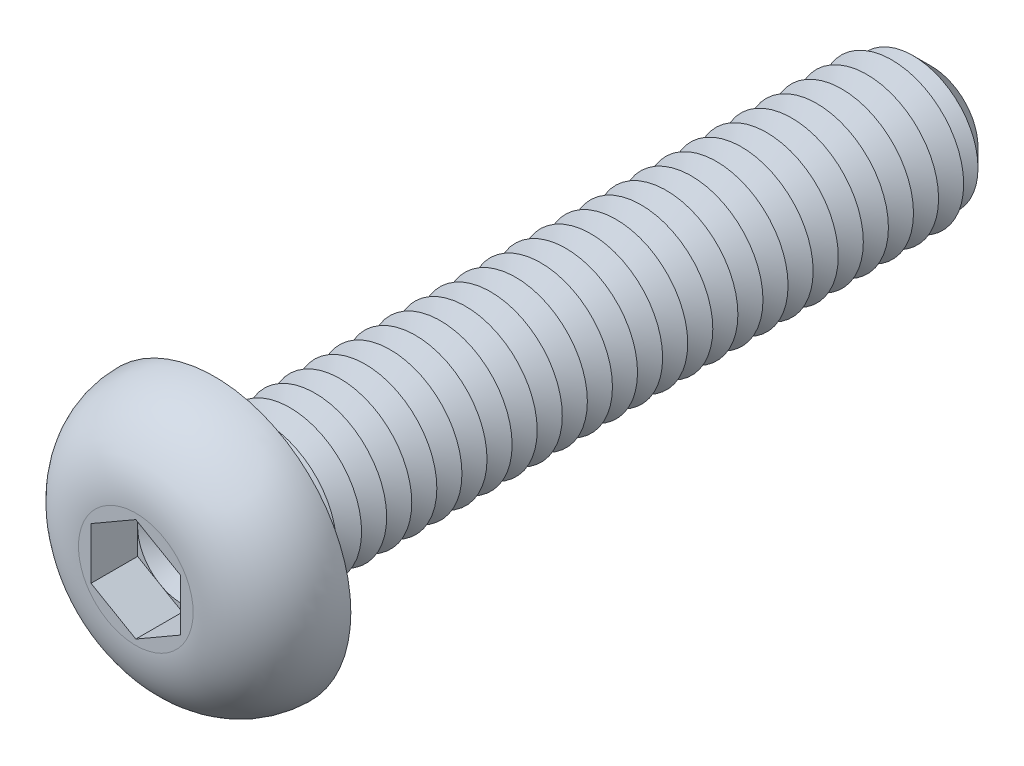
ISO-10303-21;
HEADER;
FILE_DESCRIPTION(('STEP AP214'),'2;1');
FILE_NAME('part.step','',(''),(''),'','','');
FILE_SCHEMA(('AUTOMOTIVE_DESIGN { 1 0 10303 214 1 1 1 1 }'));
ENDSEC;
DATA;
#1=APPLICATION_CONTEXT('core data for automotive mechanical design processes');
#2=APPLICATION_PROTOCOL_DEFINITION('international standard','automotive_design',2000,#1);
#3=PRODUCT_CONTEXT('',#1,'mechanical');
#4=PRODUCT('Part','Part','',(#3));
#5=PRODUCT_RELATED_PRODUCT_CATEGORY('part','',(#4));
#6=PRODUCT_DEFINITION_FORMATION('','',#4);
#7=PRODUCT_DEFINITION_CONTEXT('part definition',#1,'design');
#8=PRODUCT_DEFINITION('design','',#6,#7);
#9=PRODUCT_DEFINITION_SHAPE('','',#8);
#10=(LENGTH_UNIT() NAMED_UNIT(*) SI_UNIT(.MILLI.,.METRE.));
#11=(NAMED_UNIT(*) PLANE_ANGLE_UNIT() SI_UNIT($,.RADIAN.));
#12=(NAMED_UNIT(*) SI_UNIT($,.STERADIAN.) SOLID_ANGLE_UNIT());
#13=UNCERTAINTY_MEASURE_WITH_UNIT(LENGTH_MEASURE(1.E-05),#10,'distance_accuracy_value','');
#14=(GEOMETRIC_REPRESENTATION_CONTEXT(3) GLOBAL_UNCERTAINTY_ASSIGNED_CONTEXT((#13)) GLOBAL_UNIT_ASSIGNED_CONTEXT((#10,
#11,#12)) REPRESENTATION_CONTEXT('',''));
#15=CARTESIAN_POINT('',(0.,0.,0.));
#16=DIRECTION('',(0.,0.,1.));
#17=DIRECTION('',(1.,0.,0.));
#18=AXIS2_PLACEMENT_3D('',#15,#16,#17);
#19=CARTESIAN_POINT('',(0.,0.,0.900000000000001));
#20=DIRECTION('',(0.,0.,1.));
#21=DIRECTION('',(1.,0.,0.));
#22=AXIS2_PLACEMENT_3D('',#19,#20,#21);
#23=PLANE('',#22);
#24=CARTESIAN_POINT('',(0.,0.,0.900000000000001));
#25=DIRECTION('',(0.,0.,1.));
#26=DIRECTION('',(1.,0.,0.));
#27=AXIS2_PLACEMENT_3D('',#24,#25,#26);
#28=CIRCLE('',#27,1.25);
#29=CARTESIAN_POINT('',(1.25,0.,0.900000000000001));
#30=VERTEX_POINT('',#29);
#31=CARTESIAN_POINT('',(0.625,1.08253175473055,0.900000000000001));
#32=VERTEX_POINT('',#31);
#33=EDGE_CURVE('E117',#30,#32,#28,.T.);
#34=ORIENTED_EDGE('',*,*,#33,.F.);
#35=DIRECTION('',(0.,1.,0.));
#36=VECTOR('',#35,1.);
#37=CARTESIAN_POINT('',(1.25,-0.721687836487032,0.900000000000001));
#38=LINE('',#37,#36);
#39=CARTESIAN_POINT('',(1.25,0.721687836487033,0.900000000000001));
#40=VERTEX_POINT('',#39);
#41=EDGE_CURVE('E140',#30,#40,#38,.T.);
#42=ORIENTED_EDGE('',*,*,#41,.T.);
#43=DIRECTION('',(-0.866025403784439,0.5,0.));
#44=VECTOR('',#43,1.);
#45=CARTESIAN_POINT('',(1.25,0.721687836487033,0.900000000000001));
#46=LINE('',#45,#44);
#47=EDGE_CURVE('E135',#40,#32,#46,.T.);
#48=ORIENTED_EDGE('',*,*,#47,.T.);
#49=EDGE_LOOP('',(#34,#42,#48));
#50=FACE_BOUND('',#49,.T.);
#51=ADVANCED_FACE('F39',(#50),#23,.T.);
#52=CARTESIAN_POINT('',(0.,0.,0.900000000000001));
#53=DIRECTION('',(0.,0.,1.));
#54=DIRECTION('',(1.,0.,0.));
#55=AXIS2_PLACEMENT_3D('',#52,#53,#54);
#56=CIRCLE('',#55,1.25);
#57=CARTESIAN_POINT('',(-0.625,1.08253175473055,0.900000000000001));
#58=VERTEX_POINT('',#57);
#59=EDGE_CURVE('E11',#32,#58,#56,.T.);
#60=ORIENTED_EDGE('',*,*,#59,.F.);
#61=CARTESIAN_POINT('',(0.,1.44337567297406,0.900000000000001));
#62=VERTEX_POINT('',#61);
#63=EDGE_CURVE('E130',#32,#62,#46,.T.);
#64=ORIENTED_EDGE('',*,*,#63,.T.);
#65=DIRECTION('',(-0.866025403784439,-0.5,0.));
#66=VECTOR('',#65,1.);
#67=CARTESIAN_POINT('',(0.,1.44337567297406,0.900000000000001));
#68=LINE('',#67,#66);
#69=EDGE_CURVE('E132',#62,#58,#68,.T.);
#70=ORIENTED_EDGE('',*,*,#69,.T.);
#71=EDGE_LOOP('',(#60,#64,#70));
#72=FACE_BOUND('',#71,.T.);
#73=ADVANCED_FACE('F129',(#72),#23,.T.);
#74=CARTESIAN_POINT('',(-1.25,0.,0.900000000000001));
#75=VERTEX_POINT('',#74);
#76=EDGE_CURVE('E49',#58,#75,#56,.T.);
#77=ORIENTED_EDGE('',*,*,#76,.F.);
#78=CARTESIAN_POINT('',(-1.25,0.721687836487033,0.900000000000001));
#79=VERTEX_POINT('',#78);
#80=EDGE_CURVE('E143',#58,#79,#68,.T.);
#81=ORIENTED_EDGE('',*,*,#80,.T.);
#82=DIRECTION('',(0.,-1.,0.));
#83=VECTOR('',#82,1.);
#84=CARTESIAN_POINT('',(-1.25,0.721687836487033,0.900000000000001));
#85=LINE('',#84,#83);
#86=EDGE_CURVE('E154',#79,#75,#85,.T.);
#87=ORIENTED_EDGE('',*,*,#86,.T.);
#88=EDGE_LOOP('',(#77,#81,#87));
#89=FACE_BOUND('',#88,.T.);
#90=ADVANCED_FACE('F257',(#89),#23,.T.);
#91=CARTESIAN_POINT('',(-0.625,-1.08253175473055,0.900000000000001));
#92=VERTEX_POINT('',#91);
#93=EDGE_CURVE('E241',#75,#92,#56,.T.);
#94=ORIENTED_EDGE('',*,*,#93,.F.);
#95=CARTESIAN_POINT('',(-1.25,-0.721687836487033,0.900000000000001));
#96=VERTEX_POINT('',#95);
#97=EDGE_CURVE('E153',#75,#96,#85,.T.);
#98=ORIENTED_EDGE('',*,*,#97,.T.);
#99=DIRECTION('',(0.866025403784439,-0.5,0.));
#100=VECTOR('',#99,1.);
#101=CARTESIAN_POINT('',(-1.25,-0.721687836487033,0.900000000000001));
#102=LINE('',#101,#100);
#103=EDGE_CURVE('E159',#96,#92,#102,.T.);
#104=ORIENTED_EDGE('',*,*,#103,.T.);
#105=EDGE_LOOP('',(#94,#98,#104));
#106=FACE_BOUND('',#105,.T.);
#107=ADVANCED_FACE('F251',(#106),#23,.T.);
#108=CARTESIAN_POINT('',(0.625,-1.08253175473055,0.900000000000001));
#109=VERTEX_POINT('',#108);
#110=EDGE_CURVE('E56',#92,#109,#56,.T.);
#111=ORIENTED_EDGE('',*,*,#110,.F.);
#112=CARTESIAN_POINT('',(0.,-1.44337567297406,0.900000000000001));
#113=VERTEX_POINT('',#112);
#114=EDGE_CURVE('E158',#92,#113,#102,.T.);
#115=ORIENTED_EDGE('',*,*,#114,.T.);
#116=DIRECTION('',(0.866025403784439,0.5,0.));
#117=VECTOR('',#116,1.);
#118=CARTESIAN_POINT('',(0.,-1.44337567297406,0.900000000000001));
#119=LINE('',#118,#117);
#120=EDGE_CURVE('E164',#113,#109,#119,.T.);
#121=ORIENTED_EDGE('',*,*,#120,.T.);
#122=EDGE_LOOP('',(#111,#115,#121));
#123=FACE_BOUND('',#122,.T.);
#124=ADVANCED_FACE('F337',(#123),#23,.T.);
#125=CARTESIAN_POINT('',(0.,0.,-20.));
#126=DIRECTION('',(0.,0.,1.));
#127=DIRECTION('',(1.,0.,0.));
#128=AXIS2_PLACEMENT_3D('',#125,#126,#127);
#129=CYLINDRICAL_SURFACE('',#128,2.);
#130=CARTESIAN_POINT('',(0.,0.,-0.299999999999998));
#131=DIRECTION('',(0.,0.,1.));
#132=DIRECTION('',(1.,0.,0.));
#133=AXIS2_PLACEMENT_3D('',#130,#131,#132);
#134=CIRCLE('',#133,2.);
#135=CARTESIAN_POINT('',(2.,0.,-0.299999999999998));
#136=VERTEX_POINT('',#135);
#137=EDGE_CURVE('E222',#136,#136,#134,.F.);
#138=ORIENTED_EDGE('',*,*,#137,.T.);
#139=EDGE_LOOP('',(#138));
#140=FACE_BOUND('',#139,.T.);
#141=CARTESIAN_POINT('',(0.,0.,-0.699999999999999));
#142=DIRECTION('',(0.,0.,1.));
#143=DIRECTION('',(1.,0.,0.));
#144=AXIS2_PLACEMENT_3D('',#141,#142,#143);
#145=CIRCLE('',#144,2.);
#146=CARTESIAN_POINT('',(2.,0.,-0.699999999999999));
#147=VERTEX_POINT('',#146);
#148=EDGE_CURVE('E149',#147,#147,#145,.T.);
#149=ORIENTED_EDGE('',*,*,#148,.T.);
#150=EDGE_LOOP('',(#149));
#151=FACE_BOUND('',#150,.T.);
#152=ADVANCED_FACE('F321',(#140,#151),#129,.T.);
#153=CARTESIAN_POINT('',(0.,3.8,0.));
#154=DIRECTION('',(0.,0.,1.));
#155=DIRECTION('',(1.,0.,0.));
#156=AXIS2_PLACEMENT_3D('',#153,#154,#155);
#157=PLANE('',#156);
#158=CARTESIAN_POINT('',(0.,0.,0.));
#159=DIRECTION('',(0.,0.,1.));
#160=DIRECTION('',(1.,0.,0.));
#161=AXIS2_PLACEMENT_3D('',#158,#159,#160);
#162=CIRCLE('',#161,2.3);
#163=CARTESIAN_POINT('',(2.3,0.,0.));
#164=VERTEX_POINT('',#163);
#165=EDGE_CURVE('E231',#164,#164,#162,.T.);
#166=ORIENTED_EDGE('',*,*,#165,.T.);
#167=EDGE_LOOP('',(#166));
#168=FACE_BOUND('',#167,.T.);
#169=CARTESIAN_POINT('',(0.,0.,0.));
#170=DIRECTION('',(0.,0.,1.));
#171=DIRECTION('',(1.,0.,0.));
#172=AXIS2_PLACEMENT_3D('',#169,#170,#171);
#173=CIRCLE('',#172,3.8);
#174=CARTESIAN_POINT('',(3.8,0.,0.));
#175=VERTEX_POINT('',#174);
#176=EDGE_CURVE('E196',#175,#175,#173,.T.);
#177=ORIENTED_EDGE('',*,*,#176,.F.);
#178=EDGE_LOOP('',(#177));
#179=FACE_BOUND('',#178,.T.);
#180=ADVANCED_FACE('F367',(#168,#179),#157,.F.);
#181=CARTESIAN_POINT('',(0.,0.,2.2));
#182=DIRECTION('',(0.,0.,-1.));
#183=DIRECTION('',(-1.,0.,0.));
#184=AXIS2_PLACEMENT_3D('',#181,#182,#183);
#185=PLANE('',#184);
#186=DIRECTION('',(-0.866025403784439,-0.5,0.));
#187=VECTOR('',#186,1.);
#188=CARTESIAN_POINT('',(0.,1.44337567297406,2.2));
#189=LINE('',#188,#187);
#190=CARTESIAN_POINT('',(0.,1.44337567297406,2.2));
#191=VERTEX_POINT('',#190);
#192=CARTESIAN_POINT('',(-1.25,0.721687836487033,2.2));
#193=VERTEX_POINT('',#192);
#194=EDGE_CURVE('E174',#191,#193,#189,.T.);
#195=ORIENTED_EDGE('',*,*,#194,.F.);
#196=DIRECTION('',(-0.866025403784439,0.5,0.));
#197=VECTOR('',#196,1.);
#198=CARTESIAN_POINT('',(1.25,0.721687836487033,2.2));
#199=LINE('',#198,#197);
#200=CARTESIAN_POINT('',(1.25,0.721687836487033,2.2));
#201=VERTEX_POINT('',#200);
#202=EDGE_CURVE('E64',#201,#191,#199,.T.);
#203=ORIENTED_EDGE('',*,*,#202,.F.);
#204=DIRECTION('',(0.,1.,0.));
#205=VECTOR('',#204,1.);
#206=CARTESIAN_POINT('',(1.25,-0.721687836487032,2.2));
#207=LINE('',#206,#205);
#208=CARTESIAN_POINT('',(1.25,-0.721687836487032,2.2));
#209=VERTEX_POINT('',#208);
#210=EDGE_CURVE('E138',#209,#201,#207,.T.);
#211=ORIENTED_EDGE('',*,*,#210,.F.);
#212=DIRECTION('',(0.866025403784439,0.5,0.));
#213=VECTOR('',#212,1.);
#214=CARTESIAN_POINT('',(0.,-1.44337567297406,2.2));
#215=LINE('',#214,#213);
#216=CARTESIAN_POINT('',(0.,-1.44337567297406,2.2));
#217=VERTEX_POINT('',#216);
#218=EDGE_CURVE('E186',#217,#209,#215,.T.);
#219=ORIENTED_EDGE('',*,*,#218,.F.);
#220=DIRECTION('',(0.866025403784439,-0.5,0.));
#221=VECTOR('',#220,1.);
#222=CARTESIAN_POINT('',(-1.25,-0.721687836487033,2.2));
#223=LINE('',#222,#221);
#224=CARTESIAN_POINT('',(-1.25,-0.721687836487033,2.2));
#225=VERTEX_POINT('',#224);
#226=EDGE_CURVE('E182',#225,#217,#223,.T.);
#227=ORIENTED_EDGE('',*,*,#226,.F.);
#228=DIRECTION('',(0.,-1.,0.));
#229=VECTOR('',#228,1.);
#230=CARTESIAN_POINT('',(-1.25,0.721687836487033,2.2));
#231=LINE('',#230,#229);
#232=EDGE_CURVE('E178',#193,#225,#231,.T.);
#233=ORIENTED_EDGE('',*,*,#232,.F.);
#234=EDGE_LOOP('',(#195,#203,#211,#219,#227,#233));
#235=FACE_BOUND('',#234,.T.);
#236=CARTESIAN_POINT('',(0.,0.,2.2));
#237=DIRECTION('',(0.,0.,1.));
#238=DIRECTION('',(1.,0.,0.));
#239=AXIS2_PLACEMENT_3D('',#236,#237,#238);
#240=CIRCLE('',#239,1.6);
#241=CARTESIAN_POINT('',(1.6,0.,2.2));
#242=VERTEX_POINT('',#241);
#243=EDGE_CURVE('E214',#242,#242,#240,.T.);
#244=ORIENTED_EDGE('',*,*,#243,.T.);
#245=EDGE_LOOP('',(#244));
#246=FACE_BOUND('',#245,.T.);
#247=ADVANCED_FACE('F266',(#235,#246),#185,.F.);
#248=CARTESIAN_POINT('',(0.,0.,0.));
#249=DIRECTION('',(0.,0.,1.));
#250=DIRECTION('',(1.,0.,0.));
#251=AXIS2_PLACEMENT_3D('',#248,#249,#250);
#252=DEGENERATE_TOROIDAL_SURFACE('',#251,1.6,2.2,.T.);
#253=ORIENTED_EDGE('',*,*,#243,.F.);
#254=EDGE_LOOP('',(#253));
#255=FACE_BOUND('',#254,.T.);
#256=ORIENTED_EDGE('',*,*,#176,.T.);
#257=EDGE_LOOP('',(#256));
#258=FACE_BOUND('',#257,.T.);
#259=ADVANCED_FACE('F361',(#255,#258),#252,.T.);
#260=CARTESIAN_POINT('',(1.25,0.721687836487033,0.900000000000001));
#261=DIRECTION('',(0.5,0.866025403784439,0.));
#262=DIRECTION('',(-0.866025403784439,0.5,0.));
#263=AXIS2_PLACEMENT_3D('',#260,#261,#262);
#264=PLANE('',#263);
#265=ORIENTED_EDGE('',*,*,#202,.T.);
#266=DIRECTION('',(0.,0.,1.));
#267=VECTOR('',#266,1.);
#268=CARTESIAN_POINT('',(0.,1.44337567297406,0.900000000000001));
#269=LINE('',#268,#267);
#270=EDGE_CURVE('E136',#62,#191,#269,.T.);
#271=ORIENTED_EDGE('',*,*,#270,.F.);
#272=ORIENTED_EDGE('',*,*,#63,.F.);
#273=ORIENTED_EDGE('',*,*,#47,.F.);
#274=DIRECTION('',(0.,0.,1.));
#275=VECTOR('',#274,1.);
#276=CARTESIAN_POINT('',(1.25,0.721687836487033,0.900000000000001));
#277=LINE('',#276,#275);
#278=EDGE_CURVE('E193',#40,#201,#277,.T.);
#279=ORIENTED_EDGE('',*,*,#278,.T.);
#280=EDGE_LOOP('',(#265,#271,#272,#273,#279));
#281=FACE_BOUND('',#280,.T.);
#282=ADVANCED_FACE('F134',(#281),#264,.F.);
#283=CARTESIAN_POINT('',(1.25,-0.721687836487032,0.900000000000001));
#284=DIRECTION('',(1.,0.,0.));
#285=DIRECTION('',(0.,1.,0.));
#286=AXIS2_PLACEMENT_3D('',#283,#284,#285);
#287=PLANE('',#286);
#288=ORIENTED_EDGE('',*,*,#210,.T.);
#289=ORIENTED_EDGE('',*,*,#278,.F.);
#290=ORIENTED_EDGE('',*,*,#41,.F.);
#291=CARTESIAN_POINT('',(1.25,-0.721687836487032,0.900000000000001));
#292=VERTEX_POINT('',#291);
#293=EDGE_CURVE('E168',#292,#30,#38,.T.);
#294=ORIENTED_EDGE('',*,*,#293,.F.);
#295=DIRECTION('',(0.,0.,1.));
#296=VECTOR('',#295,1.);
#297=CARTESIAN_POINT('',(1.25,-0.721687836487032,0.900000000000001));
#298=LINE('',#297,#296);
#299=EDGE_CURVE('E197',#292,#209,#298,.T.);
#300=ORIENTED_EDGE('',*,*,#299,.T.);
#301=EDGE_LOOP('',(#288,#289,#290,#294,#300));
#302=FACE_BOUND('',#301,.T.);
#303=ADVANCED_FACE('F345',(#302),#287,.F.);
#304=CARTESIAN_POINT('',(0.,-1.44337567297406,0.900000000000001));
#305=DIRECTION('',(0.5,-0.866025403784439,0.));
#306=DIRECTION('',(0.866025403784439,0.5,0.));
#307=AXIS2_PLACEMENT_3D('',#304,#305,#306);
#308=PLANE('',#307);
#309=ORIENTED_EDGE('',*,*,#218,.T.);
#310=ORIENTED_EDGE('',*,*,#299,.F.);
#311=EDGE_CURVE('E163',#109,#292,#119,.T.);
#312=ORIENTED_EDGE('',*,*,#311,.F.);
#313=ORIENTED_EDGE('',*,*,#120,.F.);
#314=DIRECTION('',(0.,0.,1.));
#315=VECTOR('',#314,1.);
#316=CARTESIAN_POINT('',(0.,-1.44337567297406,0.900000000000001));
#317=LINE('',#316,#315);
#318=EDGE_CURVE('E200',#113,#217,#317,.T.);
#319=ORIENTED_EDGE('',*,*,#318,.T.);
#320=EDGE_LOOP('',(#309,#310,#312,#313,#319));
#321=FACE_BOUND('',#320,.T.);
#322=ADVANCED_FACE('F348',(#321),#308,.F.);
#323=CARTESIAN_POINT('',(-1.25,-0.721687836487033,0.900000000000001));
#324=DIRECTION('',(-0.5,-0.866025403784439,0.));
#325=DIRECTION('',(0.866025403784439,-0.5,0.));
#326=AXIS2_PLACEMENT_3D('',#323,#324,#325);
#327=PLANE('',#326);
#328=ORIENTED_EDGE('',*,*,#226,.T.);
#329=ORIENTED_EDGE('',*,*,#318,.F.);
#330=ORIENTED_EDGE('',*,*,#114,.F.);
#331=ORIENTED_EDGE('',*,*,#103,.F.);
#332=DIRECTION('',(0.,0.,1.));
#333=VECTOR('',#332,1.);
#334=CARTESIAN_POINT('',(-1.25,-0.721687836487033,0.900000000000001));
#335=LINE('',#334,#333);
#336=EDGE_CURVE('E203',#96,#225,#335,.T.);
#337=ORIENTED_EDGE('',*,*,#336,.T.);
#338=EDGE_LOOP('',(#328,#329,#330,#331,#337));
#339=FACE_BOUND('',#338,.T.);
#340=ADVANCED_FACE('F271',(#339),#327,.F.);
#341=CARTESIAN_POINT('',(-1.25,0.721687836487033,0.900000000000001));
#342=DIRECTION('',(-1.,0.,0.));
#343=DIRECTION('',(0.,0.,1.));
#344=AXIS2_PLACEMENT_3D('',#341,#342,#343);
#345=PLANE('',#344);
#346=ORIENTED_EDGE('',*,*,#232,.T.);
#347=ORIENTED_EDGE('',*,*,#336,.F.);
#348=ORIENTED_EDGE('',*,*,#97,.F.);
#349=ORIENTED_EDGE('',*,*,#86,.F.);
#350=DIRECTION('',(0.,0.,1.));
#351=VECTOR('',#350,1.);
#352=CARTESIAN_POINT('',(-1.25,0.721687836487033,0.900000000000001));
#353=LINE('',#352,#351);
#354=EDGE_CURVE('E206',#79,#193,#353,.T.);
#355=ORIENTED_EDGE('',*,*,#354,.T.);
#356=EDGE_LOOP('',(#346,#347,#348,#349,#355));
#357=FACE_BOUND('',#356,.T.);
#358=ADVANCED_FACE('F256',(#357),#345,.F.);
#359=CARTESIAN_POINT('',(0.,1.44337567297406,0.900000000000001));
#360=DIRECTION('',(-0.5,0.866025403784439,0.));
#361=DIRECTION('',(-0.866025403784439,-0.5,0.));
#362=AXIS2_PLACEMENT_3D('',#359,#360,#361);
#363=PLANE('',#362);
#364=ORIENTED_EDGE('',*,*,#194,.T.);
#365=ORIENTED_EDGE('',*,*,#354,.F.);
#366=ORIENTED_EDGE('',*,*,#80,.F.);
#367=ORIENTED_EDGE('',*,*,#69,.F.);
#368=ORIENTED_EDGE('',*,*,#270,.T.);
#369=EDGE_LOOP('',(#364,#365,#366,#367,#368));
#370=FACE_BOUND('',#369,.T.);
#371=ADVANCED_FACE('F260',(#370),#363,.F.);
#372=EDGE_CURVE('E43',#109,#30,#56,.T.);
#373=ORIENTED_EDGE('',*,*,#372,.F.);
#374=ORIENTED_EDGE('',*,*,#311,.T.);
#375=ORIENTED_EDGE('',*,*,#293,.T.);
#376=EDGE_LOOP('',(#373,#374,#375));
#377=FACE_BOUND('',#376,.T.);
#378=ADVANCED_FACE('F326',(#377),#23,.T.);
#379=CARTESIAN_POINT('',(0.,0.,-0.699999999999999));
#380=DIRECTION('',(0.,0.,1.));
#381=DIRECTION('',(1.,0.,0.));
#382=AXIS2_PLACEMENT_3D('',#379,#380,#381);
#383=CONICAL_SURFACE('',#382,2.,1.04719755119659);
#384=CARTESIAN_POINT('',(0.,0.,-1.05));
#385=DIRECTION('',(0.,0.,1.));
#386=DIRECTION('',(1.,0.,0.));
#387=AXIS2_PLACEMENT_3D('',#384,#385,#386);
#388=CIRCLE('',#387,1.3937822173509);
#389=CARTESIAN_POINT('',(1.3937822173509,0.,-1.05));
#390=VERTEX_POINT('',#389);
#391=EDGE_CURVE('E311',#390,#390,#388,.T.);
#392=ORIENTED_EDGE('',*,*,#391,.T.);
#393=EDGE_LOOP('',(#392));
#394=FACE_BOUND('',#393,.T.);
#395=ORIENTED_EDGE('',*,*,#148,.F.);
#396=EDGE_LOOP('',(#395));
#397=FACE_BOUND('',#396,.T.);
#398=ADVANCED_FACE('F323',(#394,#397),#383,.T.);
#399=CARTESIAN_POINT('',(0.,0.,-1.05));
#400=DIRECTION('',(0.,0.,-1.));
#401=DIRECTION('',(-1.,0.,0.));
#402=AXIS2_PLACEMENT_3D('',#399,#400,#401);
#403=CONICAL_SURFACE('',#402,1.3937822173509,1.0471975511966);
#404=CARTESIAN_POINT('',(0.,0.,-1.4));
#405=DIRECTION('',(0.,0.,1.));
#406=DIRECTION('',(1.,0.,0.));
#407=AXIS2_PLACEMENT_3D('',#404,#405,#406);
#408=CIRCLE('',#407,2.);
#409=CARTESIAN_POINT('',(2.,0.,-1.4));
#410=VERTEX_POINT('',#409);
#411=EDGE_CURVE('E308',#410,#410,#408,.T.);
#412=ORIENTED_EDGE('',*,*,#411,.T.);
#413=EDGE_LOOP('',(#412));
#414=FACE_BOUND('',#413,.T.);
#415=ORIENTED_EDGE('',*,*,#391,.F.);
#416=EDGE_LOOP('',(#415));
#417=FACE_BOUND('',#416,.T.);
#418=ADVANCED_FACE('F325',(#414,#417),#403,.T.);
#419=CARTESIAN_POINT('',(0.,0.,-1.4));
#420=DIRECTION('',(0.,0.,1.));
#421=DIRECTION('',(1.,0.,0.));
#422=AXIS2_PLACEMENT_3D('',#419,#420,#421);
#423=CONICAL_SURFACE('',#422,2.,1.04719755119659);
#424=CARTESIAN_POINT('',(0.,0.,-1.75));
#425=DIRECTION('',(0.,0.,1.));
#426=DIRECTION('',(1.,0.,0.));
#427=AXIS2_PLACEMENT_3D('',#424,#425,#426);
#428=CIRCLE('',#427,1.3937822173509);
#429=CARTESIAN_POINT('',(1.3937822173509,0.,-1.75));
#430=VERTEX_POINT('',#429);
#431=EDGE_CURVE('E305',#430,#430,#428,.T.);
#432=ORIENTED_EDGE('',*,*,#431,.T.);
#433=EDGE_LOOP('',(#432));
#434=FACE_BOUND('',#433,.T.);
#435=ORIENTED_EDGE('',*,*,#411,.F.);
#436=EDGE_LOOP('',(#435));
#437=FACE_BOUND('',#436,.T.);
#438=ADVANCED_FACE('F332',(#434,#437),#423,.T.);
#439=CARTESIAN_POINT('',(0.,0.,-1.75));
#440=DIRECTION('',(0.,0.,-1.));
#441=DIRECTION('',(-1.,0.,0.));
#442=AXIS2_PLACEMENT_3D('',#439,#440,#441);
#443=CONICAL_SURFACE('',#442,1.3937822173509,1.0471975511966);
#444=CARTESIAN_POINT('',(0.,0.,-2.1));
#445=DIRECTION('',(0.,0.,1.));
#446=DIRECTION('',(1.,0.,0.));
#447=AXIS2_PLACEMENT_3D('',#444,#445,#446);
#448=CIRCLE('',#447,2.);
#449=CARTESIAN_POINT('',(2.,0.,-2.1));
#450=VERTEX_POINT('',#449);
#451=EDGE_CURVE('E301',#450,#450,#448,.T.);
#452=ORIENTED_EDGE('',*,*,#451,.T.);
#453=EDGE_LOOP('',(#452));
#454=FACE_BOUND('',#453,.T.);
#455=ORIENTED_EDGE('',*,*,#431,.F.);
#456=EDGE_LOOP('',(#455));
#457=FACE_BOUND('',#456,.T.);
#458=ADVANCED_FACE('F593',(#454,#457),#443,.T.);
#459=CARTESIAN_POINT('',(0.,0.,-2.1));
#460=DIRECTION('',(0.,0.,1.));
#461=DIRECTION('',(1.,0.,0.));
#462=AXIS2_PLACEMENT_3D('',#459,#460,#461);
#463=CONICAL_SURFACE('',#462,2.,1.04719755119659);
#464=CARTESIAN_POINT('',(0.,0.,-2.45));
#465=DIRECTION('',(0.,0.,1.));
#466=DIRECTION('',(1.,0.,0.));
#467=AXIS2_PLACEMENT_3D('',#464,#465,#466);
#468=CIRCLE('',#467,1.3937822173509);
#469=CARTESIAN_POINT('',(1.3937822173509,0.,-2.45));
#470=VERTEX_POINT('',#469);
#471=EDGE_CURVE('E297',#470,#470,#468,.T.);
#472=ORIENTED_EDGE('',*,*,#471,.T.);
#473=EDGE_LOOP('',(#472));
#474=FACE_BOUND('',#473,.T.);
#475=ORIENTED_EDGE('',*,*,#451,.F.);
#476=EDGE_LOOP('',(#475));
#477=FACE_BOUND('',#476,.T.);
#478=ADVANCED_FACE('F589',(#474,#477),#463,.T.);
#479=CARTESIAN_POINT('',(0.,0.,-2.45));
#480=DIRECTION('',(0.,0.,-1.));
#481=DIRECTION('',(-1.,0.,0.));
#482=AXIS2_PLACEMENT_3D('',#479,#480,#481);
#483=CONICAL_SURFACE('',#482,1.3937822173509,1.0471975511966);
#484=CARTESIAN_POINT('',(0.,0.,-2.8));
#485=DIRECTION('',(0.,0.,1.));
#486=DIRECTION('',(1.,0.,0.));
#487=AXIS2_PLACEMENT_3D('',#484,#485,#486);
#488=CIRCLE('',#487,2.);
#489=CARTESIAN_POINT('',(2.,0.,-2.8));
#490=VERTEX_POINT('',#489);
#491=EDGE_CURVE('E287',#490,#490,#488,.T.);
#492=ORIENTED_EDGE('',*,*,#491,.T.);
#493=EDGE_LOOP('',(#492));
#494=FACE_BOUND('',#493,.T.);
#495=ORIENTED_EDGE('',*,*,#471,.F.);
#496=EDGE_LOOP('',(#495));
#497=FACE_BOUND('',#496,.T.);
#498=ADVANCED_FACE('F585',(#494,#497),#483,.T.);
#499=CARTESIAN_POINT('',(0.,0.,-2.8));
#500=DIRECTION('',(0.,0.,1.));
#501=DIRECTION('',(1.,0.,0.));
#502=AXIS2_PLACEMENT_3D('',#499,#500,#501);
#503=CONICAL_SURFACE('',#502,2.,1.04719755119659);
#504=CARTESIAN_POINT('',(0.,0.,-3.15));
#505=DIRECTION('',(0.,0.,1.));
#506=DIRECTION('',(1.,0.,0.));
#507=AXIS2_PLACEMENT_3D('',#504,#505,#506);
#508=CIRCLE('',#507,1.3937822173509);
#509=CARTESIAN_POINT('',(1.3937822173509,0.,-3.15));
#510=VERTEX_POINT('',#509);
#511=EDGE_CURVE('E280',#510,#510,#508,.T.);
#512=ORIENTED_EDGE('',*,*,#511,.T.);
#513=EDGE_LOOP('',(#512));
#514=FACE_BOUND('',#513,.T.);
#515=ORIENTED_EDGE('',*,*,#491,.F.);
#516=EDGE_LOOP('',(#515));
#517=FACE_BOUND('',#516,.T.);
#518=ADVANCED_FACE('F582',(#514,#517),#503,.T.);
#519=CARTESIAN_POINT('',(0.,0.,-3.15));
#520=DIRECTION('',(0.,0.,-1.));
#521=DIRECTION('',(-1.,0.,0.));
#522=AXIS2_PLACEMENT_3D('',#519,#520,#521);
#523=CONICAL_SURFACE('',#522,1.3937822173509,1.0471975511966);
#524=CARTESIAN_POINT('',(0.,0.,-3.5));
#525=DIRECTION('',(0.,0.,1.));
#526=DIRECTION('',(1.,0.,0.));
#527=AXIS2_PLACEMENT_3D('',#524,#525,#526);
#528=CIRCLE('',#527,2.);
#529=CARTESIAN_POINT('',(2.,0.,-3.5));
#530=VERTEX_POINT('',#529);
#531=EDGE_CURVE('E278',#530,#530,#528,.T.);
#532=ORIENTED_EDGE('',*,*,#531,.T.);
#533=EDGE_LOOP('',(#532));
#534=FACE_BOUND('',#533,.T.);
#535=ORIENTED_EDGE('',*,*,#511,.F.);
#536=EDGE_LOOP('',(#535));
#537=FACE_BOUND('',#536,.T.);
#538=ADVANCED_FACE('F578',(#534,#537),#523,.T.);
#539=CARTESIAN_POINT('',(0.,0.,-3.5));
#540=DIRECTION('',(0.,0.,1.));
#541=DIRECTION('',(1.,0.,0.));
#542=AXIS2_PLACEMENT_3D('',#539,#540,#541);
#543=CONICAL_SURFACE('',#542,2.,1.04719755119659);
#544=CARTESIAN_POINT('',(0.,0.,-3.85));
#545=DIRECTION('',(0.,0.,1.));
#546=DIRECTION('',(1.,0.,0.));
#547=AXIS2_PLACEMENT_3D('',#544,#545,#546);
#548=CIRCLE('',#547,1.3937822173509);
#549=CARTESIAN_POINT('',(1.3937822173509,0.,-3.85));
#550=VERTEX_POINT('',#549);
#551=EDGE_CURVE('E281',#550,#550,#548,.T.);
#552=ORIENTED_EDGE('',*,*,#551,.T.);
#553=EDGE_LOOP('',(#552));
#554=FACE_BOUND('',#553,.T.);
#555=ORIENTED_EDGE('',*,*,#531,.F.);
#556=EDGE_LOOP('',(#555));
#557=FACE_BOUND('',#556,.T.);
#558=ADVANCED_FACE('F572',(#554,#557),#543,.T.);
#559=CARTESIAN_POINT('',(0.,0.,-3.85));
#560=DIRECTION('',(0.,0.,-1.));
#561=DIRECTION('',(-1.,0.,0.));
#562=AXIS2_PLACEMENT_3D('',#559,#560,#561);
#563=CONICAL_SURFACE('',#562,1.3937822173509,1.0471975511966);
#564=CARTESIAN_POINT('',(0.,0.,-4.2));
#565=DIRECTION('',(0.,0.,1.));
#566=DIRECTION('',(1.,0.,0.));
#567=AXIS2_PLACEMENT_3D('',#564,#565,#566);
#568=CIRCLE('',#567,2.);
#569=CARTESIAN_POINT('',(2.,0.,-4.2));
#570=VERTEX_POINT('',#569);
#571=EDGE_CURVE('E291',#570,#570,#568,.T.);
#572=ORIENTED_EDGE('',*,*,#571,.T.);
#573=EDGE_LOOP('',(#572));
#574=FACE_BOUND('',#573,.T.);
#575=ORIENTED_EDGE('',*,*,#551,.F.);
#576=EDGE_LOOP('',(#575));
#577=FACE_BOUND('',#576,.T.);
#578=ADVANCED_FACE('F557',(#574,#577),#563,.T.);
#579=CARTESIAN_POINT('',(0.,0.,-4.2));
#580=DIRECTION('',(0.,0.,1.));
#581=DIRECTION('',(1.,0.,0.));
#582=AXIS2_PLACEMENT_3D('',#579,#580,#581);
#583=CONICAL_SURFACE('',#582,2.,1.04719755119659);
#584=CARTESIAN_POINT('',(0.,0.,-4.55));
#585=DIRECTION('',(0.,0.,1.));
#586=DIRECTION('',(1.,0.,0.));
#587=AXIS2_PLACEMENT_3D('',#584,#585,#586);
#588=CIRCLE('',#587,1.3937822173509);
#589=CARTESIAN_POINT('',(1.3937822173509,0.,-4.55));
#590=VERTEX_POINT('',#589);
#591=EDGE_CURVE('E551',#590,#590,#588,.T.);
#592=ORIENTED_EDGE('',*,*,#591,.T.);
#593=EDGE_LOOP('',(#592));
#594=FACE_BOUND('',#593,.T.);
#595=ORIENTED_EDGE('',*,*,#571,.F.);
#596=EDGE_LOOP('',(#595));
#597=FACE_BOUND('',#596,.T.);
#598=ADVANCED_FACE('F560',(#594,#597),#583,.T.);
#599=CARTESIAN_POINT('',(0.,0.,-4.55));
#600=DIRECTION('',(0.,0.,-1.));
#601=DIRECTION('',(-1.,0.,0.));
#602=AXIS2_PLACEMENT_3D('',#599,#600,#601);
#603=CONICAL_SURFACE('',#602,1.3937822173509,1.0471975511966);
#604=CARTESIAN_POINT('',(0.,0.,-4.9));
#605=DIRECTION('',(0.,0.,1.));
#606=DIRECTION('',(1.,0.,0.));
#607=AXIS2_PLACEMENT_3D('',#604,#605,#606);
#608=CIRCLE('',#607,2.);
#609=CARTESIAN_POINT('',(2.,0.,-4.9));
#610=VERTEX_POINT('',#609);
#611=EDGE_CURVE('E548',#610,#610,#608,.T.);
#612=ORIENTED_EDGE('',*,*,#611,.T.);
#613=EDGE_LOOP('',(#612));
#614=FACE_BOUND('',#613,.T.);
#615=ORIENTED_EDGE('',*,*,#591,.F.);
#616=EDGE_LOOP('',(#615));
#617=FACE_BOUND('',#616,.T.);
#618=ADVANCED_FACE('F562',(#614,#617),#603,.T.);
#619=CARTESIAN_POINT('',(0.,0.,-4.9));
#620=DIRECTION('',(0.,0.,1.));
#621=DIRECTION('',(1.,0.,0.));
#622=AXIS2_PLACEMENT_3D('',#619,#620,#621);
#623=CONICAL_SURFACE('',#622,2.,1.04719755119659);
#624=CARTESIAN_POINT('',(0.,0.,-5.25));
#625=DIRECTION('',(0.,0.,1.));
#626=DIRECTION('',(1.,0.,0.));
#627=AXIS2_PLACEMENT_3D('',#624,#625,#626);
#628=CIRCLE('',#627,1.3937822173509);
#629=CARTESIAN_POINT('',(1.3937822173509,0.,-5.25));
#630=VERTEX_POINT('',#629);
#631=EDGE_CURVE('E544',#630,#630,#628,.T.);
#632=ORIENTED_EDGE('',*,*,#631,.T.);
#633=EDGE_LOOP('',(#632));
#634=FACE_BOUND('',#633,.T.);
#635=ORIENTED_EDGE('',*,*,#611,.F.);
#636=EDGE_LOOP('',(#635));
#637=FACE_BOUND('',#636,.T.);
#638=ADVANCED_FACE('F569',(#634,#637),#623,.T.);
#639=CARTESIAN_POINT('',(0.,0.,-5.25));
#640=DIRECTION('',(0.,0.,-1.));
#641=DIRECTION('',(-1.,0.,0.));
#642=AXIS2_PLACEMENT_3D('',#639,#640,#641);
#643=CONICAL_SURFACE('',#642,1.3937822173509,1.0471975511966);
#644=CARTESIAN_POINT('',(0.,0.,-5.6));
#645=DIRECTION('',(0.,0.,1.));
#646=DIRECTION('',(1.,0.,0.));
#647=AXIS2_PLACEMENT_3D('',#644,#645,#646);
#648=CIRCLE('',#647,2.);
#649=CARTESIAN_POINT('',(2.,0.,-5.6));
#650=VERTEX_POINT('',#649);
#651=EDGE_CURVE('E541',#650,#650,#648,.T.);
#652=ORIENTED_EDGE('',*,*,#651,.T.);
#653=EDGE_LOOP('',(#652));
#654=FACE_BOUND('',#653,.T.);
#655=ORIENTED_EDGE('',*,*,#631,.F.);
#656=EDGE_LOOP('',(#655));
#657=FACE_BOUND('',#656,.T.);
#658=ADVANCED_FACE('F645',(#654,#657),#643,.T.);
#659=CARTESIAN_POINT('',(0.,0.,-5.6));
#660=DIRECTION('',(0.,0.,1.));
#661=DIRECTION('',(1.,0.,0.));
#662=AXIS2_PLACEMENT_3D('',#659,#660,#661);
#663=CONICAL_SURFACE('',#662,2.,1.04719755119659);
#664=CARTESIAN_POINT('',(0.,0.,-5.95));
#665=DIRECTION('',(0.,0.,1.));
#666=DIRECTION('',(1.,0.,0.));
#667=AXIS2_PLACEMENT_3D('',#664,#665,#666);
#668=CIRCLE('',#667,1.3937822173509);
#669=CARTESIAN_POINT('',(1.3937822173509,0.,-5.95));
#670=VERTEX_POINT('',#669);
#671=EDGE_CURVE('E537',#670,#670,#668,.T.);
#672=ORIENTED_EDGE('',*,*,#671,.T.);
#673=EDGE_LOOP('',(#672));
#674=FACE_BOUND('',#673,.T.);
#675=ORIENTED_EDGE('',*,*,#651,.F.);
#676=EDGE_LOOP('',(#675));
#677=FACE_BOUND('',#676,.T.);
#678=ADVANCED_FACE('F653',(#674,#677),#663,.T.);
#679=CARTESIAN_POINT('',(0.,0.,-5.95));
#680=DIRECTION('',(0.,0.,-1.));
#681=DIRECTION('',(-1.,0.,0.));
#682=AXIS2_PLACEMENT_3D('',#679,#680,#681);
#683=CONICAL_SURFACE('',#682,1.3937822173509,1.0471975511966);
#684=CARTESIAN_POINT('',(0.,0.,-6.3));
#685=DIRECTION('',(0.,0.,1.));
#686=DIRECTION('',(1.,0.,0.));
#687=AXIS2_PLACEMENT_3D('',#684,#685,#686);
#688=CIRCLE('',#687,2.);
#689=CARTESIAN_POINT('',(2.,0.,-6.3));
#690=VERTEX_POINT('',#689);
#691=EDGE_CURVE('E533',#690,#690,#688,.T.);
#692=ORIENTED_EDGE('',*,*,#691,.T.);
#693=EDGE_LOOP('',(#692));
#694=FACE_BOUND('',#693,.T.);
#695=ORIENTED_EDGE('',*,*,#671,.F.);
#696=EDGE_LOOP('',(#695));
#697=FACE_BOUND('',#696,.T.);
#698=ADVANCED_FACE('F662',(#694,#697),#683,.T.);
#699=CARTESIAN_POINT('',(0.,0.,-6.3));
#700=DIRECTION('',(0.,0.,1.));
#701=DIRECTION('',(1.,0.,0.));
#702=AXIS2_PLACEMENT_3D('',#699,#700,#701);
#703=CONICAL_SURFACE('',#702,2.,1.04719755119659);
#704=CARTESIAN_POINT('',(0.,0.,-6.65));
#705=DIRECTION('',(0.,0.,1.));
#706=DIRECTION('',(1.,0.,0.));
#707=AXIS2_PLACEMENT_3D('',#704,#705,#706);
#708=CIRCLE('',#707,1.3937822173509);
#709=CARTESIAN_POINT('',(1.3937822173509,0.,-6.65));
#710=VERTEX_POINT('',#709);
#711=EDGE_CURVE('E529',#710,#710,#708,.T.);
#712=ORIENTED_EDGE('',*,*,#711,.T.);
#713=EDGE_LOOP('',(#712));
#714=FACE_BOUND('',#713,.T.);
#715=ORIENTED_EDGE('',*,*,#691,.F.);
#716=EDGE_LOOP('',(#715));
#717=FACE_BOUND('',#716,.T.);
#718=ADVANCED_FACE('F671',(#714,#717),#703,.T.);
#719=CARTESIAN_POINT('',(0.,0.,-6.65));
#720=DIRECTION('',(0.,0.,-1.));
#721=DIRECTION('',(-1.,0.,0.));
#722=AXIS2_PLACEMENT_3D('',#719,#720,#721);
#723=CONICAL_SURFACE('',#722,1.3937822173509,1.0471975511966);
#724=CARTESIAN_POINT('',(0.,0.,-7.));
#725=DIRECTION('',(0.,0.,1.));
#726=DIRECTION('',(1.,0.,0.));
#727=AXIS2_PLACEMENT_3D('',#724,#725,#726);
#728=CIRCLE('',#727,2.);
#729=CARTESIAN_POINT('',(2.,0.,-7.));
#730=VERTEX_POINT('',#729);
#731=EDGE_CURVE('E525',#730,#730,#728,.T.);
#732=ORIENTED_EDGE('',*,*,#731,.T.);
#733=EDGE_LOOP('',(#732));
#734=FACE_BOUND('',#733,.T.);
#735=ORIENTED_EDGE('',*,*,#711,.F.);
#736=EDGE_LOOP('',(#735));
#737=FACE_BOUND('',#736,.T.);
#738=ADVANCED_FACE('F680',(#734,#737),#723,.T.);
#739=CARTESIAN_POINT('',(0.,0.,-7.));
#740=DIRECTION('',(0.,0.,1.));
#741=DIRECTION('',(1.,0.,0.));
#742=AXIS2_PLACEMENT_3D('',#739,#740,#741);
#743=CONICAL_SURFACE('',#742,2.,1.04719755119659);
#744=CARTESIAN_POINT('',(0.,0.,-7.35));
#745=DIRECTION('',(0.,0.,1.));
#746=DIRECTION('',(1.,0.,0.));
#747=AXIS2_PLACEMENT_3D('',#744,#745,#746);
#748=CIRCLE('',#747,1.3937822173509);
#749=CARTESIAN_POINT('',(1.3937822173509,0.,-7.35));
#750=VERTEX_POINT('',#749);
#751=EDGE_CURVE('E522',#750,#750,#748,.T.);
#752=ORIENTED_EDGE('',*,*,#751,.T.);
#753=EDGE_LOOP('',(#752));
#754=FACE_BOUND('',#753,.T.);
#755=ORIENTED_EDGE('',*,*,#731,.F.);
#756=EDGE_LOOP('',(#755));
#757=FACE_BOUND('',#756,.T.);
#758=ADVANCED_FACE('F689',(#754,#757),#743,.T.);
#759=CARTESIAN_POINT('',(0.,0.,-7.35));
#760=DIRECTION('',(0.,0.,-1.));
#761=DIRECTION('',(-1.,0.,0.));
#762=AXIS2_PLACEMENT_3D('',#759,#760,#761);
#763=CONICAL_SURFACE('',#762,1.3937822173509,1.0471975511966);
#764=CARTESIAN_POINT('',(0.,0.,-7.7));
#765=DIRECTION('',(0.,0.,1.));
#766=DIRECTION('',(1.,0.,0.));
#767=AXIS2_PLACEMENT_3D('',#764,#765,#766);
#768=CIRCLE('',#767,2.);
#769=CARTESIAN_POINT('',(2.,0.,-7.7));
#770=VERTEX_POINT('',#769);
#771=EDGE_CURVE('E519',#770,#770,#768,.T.);
#772=ORIENTED_EDGE('',*,*,#771,.T.);
#773=EDGE_LOOP('',(#772));
#774=FACE_BOUND('',#773,.T.);
#775=ORIENTED_EDGE('',*,*,#751,.F.);
#776=EDGE_LOOP('',(#775));
#777=FACE_BOUND('',#776,.T.);
#778=ADVANCED_FACE('F698',(#774,#777),#763,.T.);
#779=CARTESIAN_POINT('',(0.,0.,-7.7));
#780=DIRECTION('',(0.,0.,1.));
#781=DIRECTION('',(1.,0.,0.));
#782=AXIS2_PLACEMENT_3D('',#779,#780,#781);
#783=CONICAL_SURFACE('',#782,2.,1.04719755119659);
#784=CARTESIAN_POINT('',(0.,0.,-8.05));
#785=DIRECTION('',(0.,0.,1.));
#786=DIRECTION('',(1.,0.,0.));
#787=AXIS2_PLACEMENT_3D('',#784,#785,#786);
#788=CIRCLE('',#787,1.3937822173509);
#789=CARTESIAN_POINT('',(1.3937822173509,0.,-8.05));
#790=VERTEX_POINT('',#789);
#791=EDGE_CURVE('E515',#790,#790,#788,.T.);
#792=ORIENTED_EDGE('',*,*,#791,.T.);
#793=EDGE_LOOP('',(#792));
#794=FACE_BOUND('',#793,.T.);
#795=ORIENTED_EDGE('',*,*,#771,.F.);
#796=EDGE_LOOP('',(#795));
#797=FACE_BOUND('',#796,.T.);
#798=ADVANCED_FACE('F707',(#794,#797),#783,.T.);
#799=CARTESIAN_POINT('',(0.,0.,-8.05));
#800=DIRECTION('',(0.,0.,-1.));
#801=DIRECTION('',(-1.,0.,0.));
#802=AXIS2_PLACEMENT_3D('',#799,#800,#801);
#803=CONICAL_SURFACE('',#802,1.3937822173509,1.0471975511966);
#804=CARTESIAN_POINT('',(0.,0.,-8.4));
#805=DIRECTION('',(0.,0.,1.));
#806=DIRECTION('',(1.,0.,0.));
#807=AXIS2_PLACEMENT_3D('',#804,#805,#806);
#808=CIRCLE('',#807,2.);
#809=CARTESIAN_POINT('',(2.,0.,-8.4));
#810=VERTEX_POINT('',#809);
#811=EDGE_CURVE('E511',#810,#810,#808,.T.);
#812=ORIENTED_EDGE('',*,*,#811,.T.);
#813=EDGE_LOOP('',(#812));
#814=FACE_BOUND('',#813,.T.);
#815=ORIENTED_EDGE('',*,*,#791,.F.);
#816=EDGE_LOOP('',(#815));
#817=FACE_BOUND('',#816,.T.);
#818=ADVANCED_FACE('F716',(#814,#817),#803,.T.);
#819=CARTESIAN_POINT('',(0.,0.,-8.4));
#820=DIRECTION('',(0.,0.,1.));
#821=DIRECTION('',(1.,0.,0.));
#822=AXIS2_PLACEMENT_3D('',#819,#820,#821);
#823=CONICAL_SURFACE('',#822,2.,1.04719755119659);
#824=CARTESIAN_POINT('',(0.,0.,-8.75));
#825=DIRECTION('',(0.,0.,1.));
#826=DIRECTION('',(1.,0.,0.));
#827=AXIS2_PLACEMENT_3D('',#824,#825,#826);
#828=CIRCLE('',#827,1.3937822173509);
#829=CARTESIAN_POINT('',(1.3937822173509,0.,-8.75));
#830=VERTEX_POINT('',#829);
#831=EDGE_CURVE('E507',#830,#830,#828,.T.);
#832=ORIENTED_EDGE('',*,*,#831,.T.);
#833=EDGE_LOOP('',(#832));
#834=FACE_BOUND('',#833,.T.);
#835=ORIENTED_EDGE('',*,*,#811,.F.);
#836=EDGE_LOOP('',(#835));
#837=FACE_BOUND('',#836,.T.);
#838=ADVANCED_FACE('F725',(#834,#837),#823,.T.);
#839=CARTESIAN_POINT('',(0.,0.,-8.75));
#840=DIRECTION('',(0.,0.,-1.));
#841=DIRECTION('',(-1.,0.,0.));
#842=AXIS2_PLACEMENT_3D('',#839,#840,#841);
#843=CONICAL_SURFACE('',#842,1.3937822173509,1.0471975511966);
#844=CARTESIAN_POINT('',(0.,0.,-9.1));
#845=DIRECTION('',(0.,0.,1.));
#846=DIRECTION('',(1.,0.,0.));
#847=AXIS2_PLACEMENT_3D('',#844,#845,#846);
#848=CIRCLE('',#847,2.);
#849=CARTESIAN_POINT('',(2.,0.,-9.1));
#850=VERTEX_POINT('',#849);
#851=EDGE_CURVE('E503',#850,#850,#848,.T.);
#852=ORIENTED_EDGE('',*,*,#851,.T.);
#853=EDGE_LOOP('',(#852));
#854=FACE_BOUND('',#853,.T.);
#855=ORIENTED_EDGE('',*,*,#831,.F.);
#856=EDGE_LOOP('',(#855));
#857=FACE_BOUND('',#856,.T.);
#858=ADVANCED_FACE('F734',(#854,#857),#843,.T.);
#859=CARTESIAN_POINT('',(0.,0.,-9.1));
#860=DIRECTION('',(0.,0.,1.));
#861=DIRECTION('',(1.,0.,0.));
#862=AXIS2_PLACEMENT_3D('',#859,#860,#861);
#863=CONICAL_SURFACE('',#862,2.,1.04719755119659);
#864=CARTESIAN_POINT('',(0.,0.,-9.45));
#865=DIRECTION('',(0.,0.,1.));
#866=DIRECTION('',(1.,0.,0.));
#867=AXIS2_PLACEMENT_3D('',#864,#865,#866);
#868=CIRCLE('',#867,1.3937822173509);
#869=CARTESIAN_POINT('',(1.3937822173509,0.,-9.45));
#870=VERTEX_POINT('',#869);
#871=EDGE_CURVE('E499',#870,#870,#868,.T.);
#872=ORIENTED_EDGE('',*,*,#871,.T.);
#873=EDGE_LOOP('',(#872));
#874=FACE_BOUND('',#873,.T.);
#875=ORIENTED_EDGE('',*,*,#851,.F.);
#876=EDGE_LOOP('',(#875));
#877=FACE_BOUND('',#876,.T.);
#878=ADVANCED_FACE('F743',(#874,#877),#863,.T.);
#879=CARTESIAN_POINT('',(0.,0.,-9.45));
#880=DIRECTION('',(0.,0.,-1.));
#881=DIRECTION('',(-1.,0.,0.));
#882=AXIS2_PLACEMENT_3D('',#879,#880,#881);
#883=CONICAL_SURFACE('',#882,1.3937822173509,1.0471975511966);
#884=CARTESIAN_POINT('',(0.,0.,-9.8));
#885=DIRECTION('',(0.,0.,1.));
#886=DIRECTION('',(1.,0.,0.));
#887=AXIS2_PLACEMENT_3D('',#884,#885,#886);
#888=CIRCLE('',#887,2.);
#889=CARTESIAN_POINT('',(2.,0.,-9.8));
#890=VERTEX_POINT('',#889);
#891=EDGE_CURVE('E495',#890,#890,#888,.T.);
#892=ORIENTED_EDGE('',*,*,#891,.T.);
#893=EDGE_LOOP('',(#892));
#894=FACE_BOUND('',#893,.T.);
#895=ORIENTED_EDGE('',*,*,#871,.F.);
#896=EDGE_LOOP('',(#895));
#897=FACE_BOUND('',#896,.T.);
#898=ADVANCED_FACE('F752',(#894,#897),#883,.T.);
#899=CARTESIAN_POINT('',(0.,0.,-9.8));
#900=DIRECTION('',(0.,0.,1.));
#901=DIRECTION('',(1.,0.,0.));
#902=AXIS2_PLACEMENT_3D('',#899,#900,#901);
#903=CONICAL_SURFACE('',#902,2.,1.04719755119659);
#904=CARTESIAN_POINT('',(0.,0.,-10.15));
#905=DIRECTION('',(0.,0.,1.));
#906=DIRECTION('',(1.,0.,0.));
#907=AXIS2_PLACEMENT_3D('',#904,#905,#906);
#908=CIRCLE('',#907,1.3937822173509);
#909=CARTESIAN_POINT('',(1.3937822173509,0.,-10.15));
#910=VERTEX_POINT('',#909);
#911=EDGE_CURVE('E491',#910,#910,#908,.T.);
#912=ORIENTED_EDGE('',*,*,#911,.T.);
#913=EDGE_LOOP('',(#912));
#914=FACE_BOUND('',#913,.T.);
#915=ORIENTED_EDGE('',*,*,#891,.F.);
#916=EDGE_LOOP('',(#915));
#917=FACE_BOUND('',#916,.T.);
#918=ADVANCED_FACE('F761',(#914,#917),#903,.T.);
#919=CARTESIAN_POINT('',(0.,0.,-10.15));
#920=DIRECTION('',(0.,0.,-1.));
#921=DIRECTION('',(-1.,0.,0.));
#922=AXIS2_PLACEMENT_3D('',#919,#920,#921);
#923=CONICAL_SURFACE('',#922,1.3937822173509,1.0471975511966);
#924=CARTESIAN_POINT('',(0.,0.,-10.5));
#925=DIRECTION('',(0.,0.,1.));
#926=DIRECTION('',(1.,0.,0.));
#927=AXIS2_PLACEMENT_3D('',#924,#925,#926);
#928=CIRCLE('',#927,2.);
#929=CARTESIAN_POINT('',(2.,0.,-10.5));
#930=VERTEX_POINT('',#929);
#931=EDGE_CURVE('E487',#930,#930,#928,.T.);
#932=ORIENTED_EDGE('',*,*,#931,.T.);
#933=EDGE_LOOP('',(#932));
#934=FACE_BOUND('',#933,.T.);
#935=ORIENTED_EDGE('',*,*,#911,.F.);
#936=EDGE_LOOP('',(#935));
#937=FACE_BOUND('',#936,.T.);
#938=ADVANCED_FACE('F770',(#934,#937),#923,.T.);
#939=CARTESIAN_POINT('',(0.,0.,-10.5));
#940=DIRECTION('',(0.,0.,1.));
#941=DIRECTION('',(1.,0.,0.));
#942=AXIS2_PLACEMENT_3D('',#939,#940,#941);
#943=CONICAL_SURFACE('',#942,2.,1.04719755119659);
#944=CARTESIAN_POINT('',(0.,0.,-10.85));
#945=DIRECTION('',(0.,0.,1.));
#946=DIRECTION('',(1.,0.,0.));
#947=AXIS2_PLACEMENT_3D('',#944,#945,#946);
#948=CIRCLE('',#947,1.3937822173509);
#949=CARTESIAN_POINT('',(1.3937822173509,0.,-10.85));
#950=VERTEX_POINT('',#949);
#951=EDGE_CURVE('E483',#950,#950,#948,.T.);
#952=ORIENTED_EDGE('',*,*,#951,.T.);
#953=EDGE_LOOP('',(#952));
#954=FACE_BOUND('',#953,.T.);
#955=ORIENTED_EDGE('',*,*,#931,.F.);
#956=EDGE_LOOP('',(#955));
#957=FACE_BOUND('',#956,.T.);
#958=ADVANCED_FACE('F779',(#954,#957),#943,.T.);
#959=CARTESIAN_POINT('',(0.,0.,-10.85));
#960=DIRECTION('',(0.,0.,-1.));
#961=DIRECTION('',(-1.,0.,0.));
#962=AXIS2_PLACEMENT_3D('',#959,#960,#961);
#963=CONICAL_SURFACE('',#962,1.3937822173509,1.0471975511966);
#964=CARTESIAN_POINT('',(0.,0.,-11.2));
#965=DIRECTION('',(0.,0.,1.));
#966=DIRECTION('',(1.,0.,0.));
#967=AXIS2_PLACEMENT_3D('',#964,#965,#966);
#968=CIRCLE('',#967,2.);
#969=CARTESIAN_POINT('',(2.,0.,-11.2));
#970=VERTEX_POINT('',#969);
#971=EDGE_CURVE('E479',#970,#970,#968,.T.);
#972=ORIENTED_EDGE('',*,*,#971,.T.);
#973=EDGE_LOOP('',(#972));
#974=FACE_BOUND('',#973,.T.);
#975=ORIENTED_EDGE('',*,*,#951,.F.);
#976=EDGE_LOOP('',(#975));
#977=FACE_BOUND('',#976,.T.);
#978=ADVANCED_FACE('F788',(#974,#977),#963,.T.);
#979=CARTESIAN_POINT('',(0.,0.,-11.2));
#980=DIRECTION('',(0.,0.,1.));
#981=DIRECTION('',(1.,0.,0.));
#982=AXIS2_PLACEMENT_3D('',#979,#980,#981);
#983=CONICAL_SURFACE('',#982,2.,1.04719755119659);
#984=CARTESIAN_POINT('',(0.,0.,-11.55));
#985=DIRECTION('',(0.,0.,1.));
#986=DIRECTION('',(1.,0.,0.));
#987=AXIS2_PLACEMENT_3D('',#984,#985,#986);
#988=CIRCLE('',#987,1.3937822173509);
#989=CARTESIAN_POINT('',(1.3937822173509,0.,-11.55));
#990=VERTEX_POINT('',#989);
#991=EDGE_CURVE('E475',#990,#990,#988,.T.);
#992=ORIENTED_EDGE('',*,*,#991,.T.);
#993=EDGE_LOOP('',(#992));
#994=FACE_BOUND('',#993,.T.);
#995=ORIENTED_EDGE('',*,*,#971,.F.);
#996=EDGE_LOOP('',(#995));
#997=FACE_BOUND('',#996,.T.);
#998=ADVANCED_FACE('F797',(#994,#997),#983,.T.);
#999=CARTESIAN_POINT('',(0.,0.,-11.55));
#1000=DIRECTION('',(0.,0.,-1.));
#1001=DIRECTION('',(-1.,0.,0.));
#1002=AXIS2_PLACEMENT_3D('',#999,#1000,#1001);
#1003=CONICAL_SURFACE('',#1002,1.3937822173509,1.0471975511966);
#1004=CARTESIAN_POINT('',(0.,0.,-11.9));
#1005=DIRECTION('',(0.,0.,1.));
#1006=DIRECTION('',(1.,0.,0.));
#1007=AXIS2_PLACEMENT_3D('',#1004,#1005,#1006);
#1008=CIRCLE('',#1007,2.);
#1009=CARTESIAN_POINT('',(2.,0.,-11.9));
#1010=VERTEX_POINT('',#1009);
#1011=EDGE_CURVE('E471',#1010,#1010,#1008,.T.);
#1012=ORIENTED_EDGE('',*,*,#1011,.T.);
#1013=EDGE_LOOP('',(#1012));
#1014=FACE_BOUND('',#1013,.T.);
#1015=ORIENTED_EDGE('',*,*,#991,.F.);
#1016=EDGE_LOOP('',(#1015));
#1017=FACE_BOUND('',#1016,.T.);
#1018=ADVANCED_FACE('F806',(#1014,#1017),#1003,.T.);
#1019=CARTESIAN_POINT('',(0.,0.,-11.9));
#1020=DIRECTION('',(0.,0.,1.));
#1021=DIRECTION('',(1.,0.,0.));
#1022=AXIS2_PLACEMENT_3D('',#1019,#1020,#1021);
#1023=CONICAL_SURFACE('',#1022,2.,1.04719755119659);
#1024=CARTESIAN_POINT('',(0.,0.,-12.25));
#1025=DIRECTION('',(0.,0.,1.));
#1026=DIRECTION('',(1.,0.,0.));
#1027=AXIS2_PLACEMENT_3D('',#1024,#1025,#1026);
#1028=CIRCLE('',#1027,1.3937822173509);
#1029=CARTESIAN_POINT('',(1.3937822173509,0.,-12.25));
#1030=VERTEX_POINT('',#1029);
#1031=EDGE_CURVE('E467',#1030,#1030,#1028,.T.);
#1032=ORIENTED_EDGE('',*,*,#1031,.T.);
#1033=EDGE_LOOP('',(#1032));
#1034=FACE_BOUND('',#1033,.T.);
#1035=ORIENTED_EDGE('',*,*,#1011,.F.);
#1036=EDGE_LOOP('',(#1035));
#1037=FACE_BOUND('',#1036,.T.);
#1038=ADVANCED_FACE('F815',(#1034,#1037),#1023,.T.);
#1039=CARTESIAN_POINT('',(0.,0.,-12.25));
#1040=DIRECTION('',(0.,0.,-1.));
#1041=DIRECTION('',(-1.,0.,0.));
#1042=AXIS2_PLACEMENT_3D('',#1039,#1040,#1041);
#1043=CONICAL_SURFACE('',#1042,1.3937822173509,1.0471975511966);
#1044=CARTESIAN_POINT('',(0.,0.,-12.6));
#1045=DIRECTION('',(0.,0.,1.));
#1046=DIRECTION('',(1.,0.,0.));
#1047=AXIS2_PLACEMENT_3D('',#1044,#1045,#1046);
#1048=CIRCLE('',#1047,2.);
#1049=CARTESIAN_POINT('',(2.,0.,-12.6));
#1050=VERTEX_POINT('',#1049);
#1051=EDGE_CURVE('E463',#1050,#1050,#1048,.T.);
#1052=ORIENTED_EDGE('',*,*,#1051,.T.);
#1053=EDGE_LOOP('',(#1052));
#1054=FACE_BOUND('',#1053,.T.);
#1055=ORIENTED_EDGE('',*,*,#1031,.F.);
#1056=EDGE_LOOP('',(#1055));
#1057=FACE_BOUND('',#1056,.T.);
#1058=ADVANCED_FACE('F824',(#1054,#1057),#1043,.T.);
#1059=CARTESIAN_POINT('',(0.,0.,-12.6));
#1060=DIRECTION('',(0.,0.,1.));
#1061=DIRECTION('',(1.,0.,0.));
#1062=AXIS2_PLACEMENT_3D('',#1059,#1060,#1061);
#1063=CONICAL_SURFACE('',#1062,2.,1.04719755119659);
#1064=CARTESIAN_POINT('',(0.,0.,-12.95));
#1065=DIRECTION('',(0.,0.,1.));
#1066=DIRECTION('',(1.,0.,0.));
#1067=AXIS2_PLACEMENT_3D('',#1064,#1065,#1066);
#1068=CIRCLE('',#1067,1.3937822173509);
#1069=CARTESIAN_POINT('',(1.3937822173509,0.,-12.95));
#1070=VERTEX_POINT('',#1069);
#1071=EDGE_CURVE('E459',#1070,#1070,#1068,.T.);
#1072=ORIENTED_EDGE('',*,*,#1071,.T.);
#1073=EDGE_LOOP('',(#1072));
#1074=FACE_BOUND('',#1073,.T.);
#1075=ORIENTED_EDGE('',*,*,#1051,.F.);
#1076=EDGE_LOOP('',(#1075));
#1077=FACE_BOUND('',#1076,.T.);
#1078=ADVANCED_FACE('F833',(#1074,#1077),#1063,.T.);
#1079=CARTESIAN_POINT('',(0.,0.,-12.95));
#1080=DIRECTION('',(0.,0.,-1.));
#1081=DIRECTION('',(-1.,0.,0.));
#1082=AXIS2_PLACEMENT_3D('',#1079,#1080,#1081);
#1083=CONICAL_SURFACE('',#1082,1.3937822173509,1.0471975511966);
#1084=CARTESIAN_POINT('',(0.,0.,-13.3));
#1085=DIRECTION('',(0.,0.,1.));
#1086=DIRECTION('',(1.,0.,0.));
#1087=AXIS2_PLACEMENT_3D('',#1084,#1085,#1086);
#1088=CIRCLE('',#1087,2.);
#1089=CARTESIAN_POINT('',(2.,0.,-13.3));
#1090=VERTEX_POINT('',#1089);
#1091=EDGE_CURVE('E455',#1090,#1090,#1088,.T.);
#1092=ORIENTED_EDGE('',*,*,#1091,.T.);
#1093=EDGE_LOOP('',(#1092));
#1094=FACE_BOUND('',#1093,.T.);
#1095=ORIENTED_EDGE('',*,*,#1071,.F.);
#1096=EDGE_LOOP('',(#1095));
#1097=FACE_BOUND('',#1096,.T.);
#1098=ADVANCED_FACE('F842',(#1094,#1097),#1083,.T.);
#1099=CARTESIAN_POINT('',(0.,0.,-13.3));
#1100=DIRECTION('',(0.,0.,1.));
#1101=DIRECTION('',(1.,0.,0.));
#1102=AXIS2_PLACEMENT_3D('',#1099,#1100,#1101);
#1103=CONICAL_SURFACE('',#1102,2.,1.04719755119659);
#1104=CARTESIAN_POINT('',(0.,0.,-13.65));
#1105=DIRECTION('',(0.,0.,1.));
#1106=DIRECTION('',(1.,0.,0.));
#1107=AXIS2_PLACEMENT_3D('',#1104,#1105,#1106);
#1108=CIRCLE('',#1107,1.3937822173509);
#1109=CARTESIAN_POINT('',(1.3937822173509,0.,-13.65));
#1110=VERTEX_POINT('',#1109);
#1111=EDGE_CURVE('E451',#1110,#1110,#1108,.T.);
#1112=ORIENTED_EDGE('',*,*,#1111,.T.);
#1113=EDGE_LOOP('',(#1112));
#1114=FACE_BOUND('',#1113,.T.);
#1115=ORIENTED_EDGE('',*,*,#1091,.F.);
#1116=EDGE_LOOP('',(#1115));
#1117=FACE_BOUND('',#1116,.T.);
#1118=ADVANCED_FACE('F851',(#1114,#1117),#1103,.T.);
#1119=CARTESIAN_POINT('',(0.,0.,-13.65));
#1120=DIRECTION('',(0.,0.,-1.));
#1121=DIRECTION('',(-1.,0.,0.));
#1122=AXIS2_PLACEMENT_3D('',#1119,#1120,#1121);
#1123=CONICAL_SURFACE('',#1122,1.3937822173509,1.0471975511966);
#1124=CARTESIAN_POINT('',(0.,0.,-14.));
#1125=DIRECTION('',(0.,0.,1.));
#1126=DIRECTION('',(1.,0.,0.));
#1127=AXIS2_PLACEMENT_3D('',#1124,#1125,#1126);
#1128=CIRCLE('',#1127,2.);
#1129=CARTESIAN_POINT('',(2.,0.,-14.));
#1130=VERTEX_POINT('',#1129);
#1131=EDGE_CURVE('E447',#1130,#1130,#1128,.T.);
#1132=ORIENTED_EDGE('',*,*,#1131,.T.);
#1133=EDGE_LOOP('',(#1132));
#1134=FACE_BOUND('',#1133,.T.);
#1135=ORIENTED_EDGE('',*,*,#1111,.F.);
#1136=EDGE_LOOP('',(#1135));
#1137=FACE_BOUND('',#1136,.T.);
#1138=ADVANCED_FACE('F860',(#1134,#1137),#1123,.T.);
#1139=CARTESIAN_POINT('',(0.,0.,-14.));
#1140=DIRECTION('',(0.,0.,1.));
#1141=DIRECTION('',(1.,0.,0.));
#1142=AXIS2_PLACEMENT_3D('',#1139,#1140,#1141);
#1143=CONICAL_SURFACE('',#1142,2.,1.04719755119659);
#1144=CARTESIAN_POINT('',(0.,0.,-14.35));
#1145=DIRECTION('',(0.,0.,1.));
#1146=DIRECTION('',(1.,0.,0.));
#1147=AXIS2_PLACEMENT_3D('',#1144,#1145,#1146);
#1148=CIRCLE('',#1147,1.3937822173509);
#1149=CARTESIAN_POINT('',(1.3937822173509,0.,-14.35));
#1150=VERTEX_POINT('',#1149);
#1151=EDGE_CURVE('E443',#1150,#1150,#1148,.T.);
#1152=ORIENTED_EDGE('',*,*,#1151,.T.);
#1153=EDGE_LOOP('',(#1152));
#1154=FACE_BOUND('',#1153,.T.);
#1155=ORIENTED_EDGE('',*,*,#1131,.F.);
#1156=EDGE_LOOP('',(#1155));
#1157=FACE_BOUND('',#1156,.T.);
#1158=ADVANCED_FACE('F869',(#1154,#1157),#1143,.T.);
#1159=CARTESIAN_POINT('',(0.,0.,-14.35));
#1160=DIRECTION('',(0.,0.,-1.));
#1161=DIRECTION('',(-1.,0.,0.));
#1162=AXIS2_PLACEMENT_3D('',#1159,#1160,#1161);
#1163=CONICAL_SURFACE('',#1162,1.3937822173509,1.0471975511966);
#1164=CARTESIAN_POINT('',(0.,0.,-14.7));
#1165=DIRECTION('',(0.,0.,1.));
#1166=DIRECTION('',(1.,0.,0.));
#1167=AXIS2_PLACEMENT_3D('',#1164,#1165,#1166);
#1168=CIRCLE('',#1167,2.);
#1169=CARTESIAN_POINT('',(2.,0.,-14.7));
#1170=VERTEX_POINT('',#1169);
#1171=EDGE_CURVE('E439',#1170,#1170,#1168,.T.);
#1172=ORIENTED_EDGE('',*,*,#1171,.T.);
#1173=EDGE_LOOP('',(#1172));
#1174=FACE_BOUND('',#1173,.T.);
#1175=ORIENTED_EDGE('',*,*,#1151,.F.);
#1176=EDGE_LOOP('',(#1175));
#1177=FACE_BOUND('',#1176,.T.);
#1178=ADVANCED_FACE('F878',(#1174,#1177),#1163,.T.);
#1179=CARTESIAN_POINT('',(0.,0.,-14.7));
#1180=DIRECTION('',(0.,0.,1.));
#1181=DIRECTION('',(1.,0.,0.));
#1182=AXIS2_PLACEMENT_3D('',#1179,#1180,#1181);
#1183=CONICAL_SURFACE('',#1182,2.,1.04719755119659);
#1184=CARTESIAN_POINT('',(0.,0.,-15.05));
#1185=DIRECTION('',(0.,0.,1.));
#1186=DIRECTION('',(1.,0.,0.));
#1187=AXIS2_PLACEMENT_3D('',#1184,#1185,#1186);
#1188=CIRCLE('',#1187,1.3937822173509);
#1189=CARTESIAN_POINT('',(1.3937822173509,0.,-15.05));
#1190=VERTEX_POINT('',#1189);
#1191=EDGE_CURVE('E436',#1190,#1190,#1188,.T.);
#1192=ORIENTED_EDGE('',*,*,#1191,.T.);
#1193=EDGE_LOOP('',(#1192));
#1194=FACE_BOUND('',#1193,.T.);
#1195=ORIENTED_EDGE('',*,*,#1171,.F.);
#1196=EDGE_LOOP('',(#1195));
#1197=FACE_BOUND('',#1196,.T.);
#1198=ADVANCED_FACE('F887',(#1194,#1197),#1183,.T.);
#1199=CARTESIAN_POINT('',(0.,0.,-15.05));
#1200=DIRECTION('',(0.,0.,-1.));
#1201=DIRECTION('',(-1.,0.,0.));
#1202=AXIS2_PLACEMENT_3D('',#1199,#1200,#1201);
#1203=CONICAL_SURFACE('',#1202,1.3937822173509,1.0471975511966);
#1204=CARTESIAN_POINT('',(0.,0.,-15.4));
#1205=DIRECTION('',(0.,0.,1.));
#1206=DIRECTION('',(1.,0.,0.));
#1207=AXIS2_PLACEMENT_3D('',#1204,#1205,#1206);
#1208=CIRCLE('',#1207,2.);
#1209=CARTESIAN_POINT('',(2.,0.,-15.4));
#1210=VERTEX_POINT('',#1209);
#1211=EDGE_CURVE('E432',#1210,#1210,#1208,.T.);
#1212=ORIENTED_EDGE('',*,*,#1211,.T.);
#1213=EDGE_LOOP('',(#1212));
#1214=FACE_BOUND('',#1213,.T.);
#1215=ORIENTED_EDGE('',*,*,#1191,.F.);
#1216=EDGE_LOOP('',(#1215));
#1217=FACE_BOUND('',#1216,.T.);
#1218=ADVANCED_FACE('F896',(#1214,#1217),#1203,.T.);
#1219=CARTESIAN_POINT('',(0.,0.,-15.4));
#1220=DIRECTION('',(0.,0.,1.));
#1221=DIRECTION('',(1.,0.,0.));
#1222=AXIS2_PLACEMENT_3D('',#1219,#1220,#1221);
#1223=CONICAL_SURFACE('',#1222,2.,1.04719755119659);
#1224=CARTESIAN_POINT('',(0.,0.,-15.75));
#1225=DIRECTION('',(0.,0.,1.));
#1226=DIRECTION('',(1.,0.,0.));
#1227=AXIS2_PLACEMENT_3D('',#1224,#1225,#1226);
#1228=CIRCLE('',#1227,1.3937822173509);
#1229=CARTESIAN_POINT('',(1.3937822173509,0.,-15.75));
#1230=VERTEX_POINT('',#1229);
#1231=EDGE_CURVE('E428',#1230,#1230,#1228,.T.);
#1232=ORIENTED_EDGE('',*,*,#1231,.T.);
#1233=EDGE_LOOP('',(#1232));
#1234=FACE_BOUND('',#1233,.T.);
#1235=ORIENTED_EDGE('',*,*,#1211,.F.);
#1236=EDGE_LOOP('',(#1235));
#1237=FACE_BOUND('',#1236,.T.);
#1238=ADVANCED_FACE('F905',(#1234,#1237),#1223,.T.);
#1239=CARTESIAN_POINT('',(0.,0.,-15.75));
#1240=DIRECTION('',(0.,0.,-1.));
#1241=DIRECTION('',(-1.,0.,0.));
#1242=AXIS2_PLACEMENT_3D('',#1239,#1240,#1241);
#1243=CONICAL_SURFACE('',#1242,1.3937822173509,1.0471975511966);
#1244=CARTESIAN_POINT('',(0.,0.,-16.1));
#1245=DIRECTION('',(0.,0.,1.));
#1246=DIRECTION('',(1.,0.,0.));
#1247=AXIS2_PLACEMENT_3D('',#1244,#1245,#1246);
#1248=CIRCLE('',#1247,2.);
#1249=CARTESIAN_POINT('',(2.,0.,-16.1));
#1250=VERTEX_POINT('',#1249);
#1251=EDGE_CURVE('E424',#1250,#1250,#1248,.T.);
#1252=ORIENTED_EDGE('',*,*,#1251,.T.);
#1253=EDGE_LOOP('',(#1252));
#1254=FACE_BOUND('',#1253,.T.);
#1255=ORIENTED_EDGE('',*,*,#1231,.F.);
#1256=EDGE_LOOP('',(#1255));
#1257=FACE_BOUND('',#1256,.T.);
#1258=ADVANCED_FACE('F914',(#1254,#1257),#1243,.T.);
#1259=CARTESIAN_POINT('',(0.,0.,-16.1));
#1260=DIRECTION('',(0.,0.,1.));
#1261=DIRECTION('',(1.,0.,0.));
#1262=AXIS2_PLACEMENT_3D('',#1259,#1260,#1261);
#1263=CONICAL_SURFACE('',#1262,2.,1.04719755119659);
#1264=CARTESIAN_POINT('',(0.,0.,-16.45));
#1265=DIRECTION('',(0.,0.,1.));
#1266=DIRECTION('',(1.,0.,0.));
#1267=AXIS2_PLACEMENT_3D('',#1264,#1265,#1266);
#1268=CIRCLE('',#1267,1.3937822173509);
#1269=CARTESIAN_POINT('',(1.3937822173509,0.,-16.45));
#1270=VERTEX_POINT('',#1269);
#1271=EDGE_CURVE('E420',#1270,#1270,#1268,.T.);
#1272=ORIENTED_EDGE('',*,*,#1271,.T.);
#1273=EDGE_LOOP('',(#1272));
#1274=FACE_BOUND('',#1273,.T.);
#1275=ORIENTED_EDGE('',*,*,#1251,.F.);
#1276=EDGE_LOOP('',(#1275));
#1277=FACE_BOUND('',#1276,.T.);
#1278=ADVANCED_FACE('F923',(#1274,#1277),#1263,.T.);
#1279=CARTESIAN_POINT('',(0.,0.,-16.45));
#1280=DIRECTION('',(0.,0.,-1.));
#1281=DIRECTION('',(-1.,0.,0.));
#1282=AXIS2_PLACEMENT_3D('',#1279,#1280,#1281);
#1283=CONICAL_SURFACE('',#1282,1.3937822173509,1.0471975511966);
#1284=CARTESIAN_POINT('',(0.,0.,-16.8));
#1285=DIRECTION('',(0.,0.,1.));
#1286=DIRECTION('',(1.,0.,0.));
#1287=AXIS2_PLACEMENT_3D('',#1284,#1285,#1286);
#1288=CIRCLE('',#1287,2.);
#1289=CARTESIAN_POINT('',(2.,0.,-16.8));
#1290=VERTEX_POINT('',#1289);
#1291=EDGE_CURVE('E417',#1290,#1290,#1288,.T.);
#1292=ORIENTED_EDGE('',*,*,#1291,.T.);
#1293=EDGE_LOOP('',(#1292));
#1294=FACE_BOUND('',#1293,.T.);
#1295=ORIENTED_EDGE('',*,*,#1271,.F.);
#1296=EDGE_LOOP('',(#1295));
#1297=FACE_BOUND('',#1296,.T.);
#1298=ADVANCED_FACE('F932',(#1294,#1297),#1283,.T.);
#1299=CARTESIAN_POINT('',(0.,0.,-16.8));
#1300=DIRECTION('',(0.,0.,1.));
#1301=DIRECTION('',(1.,0.,0.));
#1302=AXIS2_PLACEMENT_3D('',#1299,#1300,#1301);
#1303=CONICAL_SURFACE('',#1302,2.,1.04719755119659);
#1304=CARTESIAN_POINT('',(0.,0.,-17.15));
#1305=DIRECTION('',(0.,0.,1.));
#1306=DIRECTION('',(1.,0.,0.));
#1307=AXIS2_PLACEMENT_3D('',#1304,#1305,#1306);
#1308=CIRCLE('',#1307,1.3937822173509);
#1309=CARTESIAN_POINT('',(1.3937822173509,0.,-17.15));
#1310=VERTEX_POINT('',#1309);
#1311=EDGE_CURVE('E413',#1310,#1310,#1308,.T.);
#1312=ORIENTED_EDGE('',*,*,#1311,.T.);
#1313=EDGE_LOOP('',(#1312));
#1314=FACE_BOUND('',#1313,.T.);
#1315=ORIENTED_EDGE('',*,*,#1291,.F.);
#1316=EDGE_LOOP('',(#1315));
#1317=FACE_BOUND('',#1316,.T.);
#1318=ADVANCED_FACE('F941',(#1314,#1317),#1303,.T.);
#1319=CARTESIAN_POINT('',(0.,0.,-17.15));
#1320=DIRECTION('',(0.,0.,-1.));
#1321=DIRECTION('',(-1.,0.,0.));
#1322=AXIS2_PLACEMENT_3D('',#1319,#1320,#1321);
#1323=CONICAL_SURFACE('',#1322,1.3937822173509,1.0471975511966);
#1324=CARTESIAN_POINT('',(0.,0.,-17.5));
#1325=DIRECTION('',(0.,0.,1.));
#1326=DIRECTION('',(1.,0.,0.));
#1327=AXIS2_PLACEMENT_3D('',#1324,#1325,#1326);
#1328=CIRCLE('',#1327,2.);
#1329=CARTESIAN_POINT('',(2.,0.,-17.5));
#1330=VERTEX_POINT('',#1329);
#1331=EDGE_CURVE('E409',#1330,#1330,#1328,.T.);
#1332=ORIENTED_EDGE('',*,*,#1331,.T.);
#1333=EDGE_LOOP('',(#1332));
#1334=FACE_BOUND('',#1333,.T.);
#1335=ORIENTED_EDGE('',*,*,#1311,.F.);
#1336=EDGE_LOOP('',(#1335));
#1337=FACE_BOUND('',#1336,.T.);
#1338=ADVANCED_FACE('F950',(#1334,#1337),#1323,.T.);
#1339=CARTESIAN_POINT('',(0.,0.,-17.5));
#1340=DIRECTION('',(0.,0.,1.));
#1341=DIRECTION('',(1.,0.,0.));
#1342=AXIS2_PLACEMENT_3D('',#1339,#1340,#1341);
#1343=CONICAL_SURFACE('',#1342,2.,1.04719755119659);
#1344=CARTESIAN_POINT('',(0.,0.,-17.85));
#1345=DIRECTION('',(0.,0.,1.));
#1346=DIRECTION('',(1.,0.,0.));
#1347=AXIS2_PLACEMENT_3D('',#1344,#1345,#1346);
#1348=CIRCLE('',#1347,1.3937822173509);
#1349=CARTESIAN_POINT('',(1.3937822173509,0.,-17.85));
#1350=VERTEX_POINT('',#1349);
#1351=EDGE_CURVE('E405',#1350,#1350,#1348,.T.);
#1352=ORIENTED_EDGE('',*,*,#1351,.T.);
#1353=EDGE_LOOP('',(#1352));
#1354=FACE_BOUND('',#1353,.T.);
#1355=ORIENTED_EDGE('',*,*,#1331,.F.);
#1356=EDGE_LOOP('',(#1355));
#1357=FACE_BOUND('',#1356,.T.);
#1358=ADVANCED_FACE('F959',(#1354,#1357),#1343,.T.);
#1359=CARTESIAN_POINT('',(0.,0.,-17.85));
#1360=DIRECTION('',(0.,0.,-1.));
#1361=DIRECTION('',(-1.,0.,0.));
#1362=AXIS2_PLACEMENT_3D('',#1359,#1360,#1361);
#1363=CONICAL_SURFACE('',#1362,1.3937822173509,1.0471975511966);
#1364=CARTESIAN_POINT('',(0.,0.,-18.2));
#1365=DIRECTION('',(0.,0.,1.));
#1366=DIRECTION('',(1.,0.,0.));
#1367=AXIS2_PLACEMENT_3D('',#1364,#1365,#1366);
#1368=CIRCLE('',#1367,2.);
#1369=CARTESIAN_POINT('',(2.,0.,-18.2));
#1370=VERTEX_POINT('',#1369);
#1371=EDGE_CURVE('E401',#1370,#1370,#1368,.T.);
#1372=ORIENTED_EDGE('',*,*,#1371,.T.);
#1373=EDGE_LOOP('',(#1372));
#1374=FACE_BOUND('',#1373,.T.);
#1375=ORIENTED_EDGE('',*,*,#1351,.F.);
#1376=EDGE_LOOP('',(#1375));
#1377=FACE_BOUND('',#1376,.T.);
#1378=ADVANCED_FACE('F968',(#1374,#1377),#1363,.T.);
#1379=CARTESIAN_POINT('',(0.,0.,-18.2));
#1380=DIRECTION('',(0.,0.,1.));
#1381=DIRECTION('',(1.,0.,0.));
#1382=AXIS2_PLACEMENT_3D('',#1379,#1380,#1381);
#1383=CONICAL_SURFACE('',#1382,2.,1.04719755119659);
#1384=CARTESIAN_POINT('',(0.,0.,-18.55));
#1385=DIRECTION('',(0.,0.,1.));
#1386=DIRECTION('',(1.,0.,0.));
#1387=AXIS2_PLACEMENT_3D('',#1384,#1385,#1386);
#1388=CIRCLE('',#1387,1.3937822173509);
#1389=CARTESIAN_POINT('',(1.3937822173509,0.,-18.55));
#1390=VERTEX_POINT('',#1389);
#1391=EDGE_CURVE('E227',#1390,#1390,#1388,.T.);
#1392=ORIENTED_EDGE('',*,*,#1391,.T.);
#1393=EDGE_LOOP('',(#1392));
#1394=FACE_BOUND('',#1393,.T.);
#1395=ORIENTED_EDGE('',*,*,#1371,.F.);
#1396=EDGE_LOOP('',(#1395));
#1397=FACE_BOUND('',#1396,.T.);
#1398=ADVANCED_FACE('F977',(#1394,#1397),#1383,.T.);
#1399=CARTESIAN_POINT('',(0.,0.,-18.55));
#1400=DIRECTION('',(0.,0.,-1.));
#1401=DIRECTION('',(-1.,0.,0.));
#1402=AXIS2_PLACEMENT_3D('',#1399,#1400,#1401);
#1403=CONICAL_SURFACE('',#1402,1.3937822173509,1.0471975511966);
#1404=CARTESIAN_POINT('',(0.,0.,-18.9));
#1405=DIRECTION('',(0.,0.,1.));
#1406=DIRECTION('',(1.,0.,0.));
#1407=AXIS2_PLACEMENT_3D('',#1404,#1405,#1406);
#1408=CIRCLE('',#1407,2.);
#1409=CARTESIAN_POINT('',(2.,0.,-18.9));
#1410=VERTEX_POINT('',#1409);
#1411=EDGE_CURVE('E228',#1410,#1410,#1408,.T.);
#1412=ORIENTED_EDGE('',*,*,#1411,.T.);
#1413=EDGE_LOOP('',(#1412));
#1414=FACE_BOUND('',#1413,.T.);
#1415=ORIENTED_EDGE('',*,*,#1391,.F.);
#1416=EDGE_LOOP('',(#1415));
#1417=FACE_BOUND('',#1416,.T.);
#1418=ADVANCED_FACE('F986',(#1414,#1417),#1403,.T.);
#1419=CARTESIAN_POINT('',(0.,0.,-18.9));
#1420=DIRECTION('',(0.,0.,1.));
#1421=DIRECTION('',(1.,0.,0.));
#1422=AXIS2_PLACEMENT_3D('',#1419,#1420,#1421);
#1423=CONICAL_SURFACE('',#1422,2.,1.04719755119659);
#1424=CARTESIAN_POINT('',(0.,0.,-19.25));
#1425=DIRECTION('',(0.,0.,1.));
#1426=DIRECTION('',(1.,0.,0.));
#1427=AXIS2_PLACEMENT_3D('',#1424,#1425,#1426);
#1428=CIRCLE('',#1427,1.3937822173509);
#1429=CARTESIAN_POINT('',(1.3937822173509,0.,-19.25));
#1430=VERTEX_POINT('',#1429);
#1431=EDGE_CURVE('E124',#1430,#1430,#1428,.T.);
#1432=ORIENTED_EDGE('',*,*,#1431,.T.);
#1433=EDGE_LOOP('',(#1432));
#1434=FACE_BOUND('',#1433,.T.);
#1435=ORIENTED_EDGE('',*,*,#1411,.F.);
#1436=EDGE_LOOP('',(#1435));
#1437=FACE_BOUND('',#1436,.T.);
#1438=ADVANCED_FACE('F386',(#1434,#1437),#1423,.T.);
#1439=CARTESIAN_POINT('',(0.,0.,-19.25));
#1440=DIRECTION('',(0.,0.,-1.));
#1441=DIRECTION('',(-1.,0.,0.));
#1442=AXIS2_PLACEMENT_3D('',#1439,#1440,#1441);
#1443=CONICAL_SURFACE('',#1442,1.3937822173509,1.0471975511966);
#1444=CARTESIAN_POINT('',(0.,0.,-19.4901923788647));
#1445=DIRECTION('',(0.,0.,-1.));
#1446=DIRECTION('',(-1.,0.,0.));
#1447=AXIS2_PLACEMENT_3D('',#1444,#1445,#1446);
#1448=CIRCLE('',#1447,1.80980762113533);
#1449=CARTESIAN_POINT('',(1.80980762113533,0.,-19.4901923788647));
#1450=VERTEX_POINT('',#1449);
#1451=EDGE_CURVE('E223',#1450,#1450,#1448,.T.);
#1452=ORIENTED_EDGE('',*,*,#1451,.F.);
#1453=EDGE_LOOP('',(#1452));
#1454=FACE_BOUND('',#1453,.T.);
#1455=ORIENTED_EDGE('',*,*,#1431,.F.);
#1456=EDGE_LOOP('',(#1455));
#1457=FACE_BOUND('',#1456,.T.);
#1458=ADVANCED_FACE('F378',(#1454,#1457),#1443,.T.);
#1459=CARTESIAN_POINT('',(0.,0.,-20.));
#1460=DIRECTION('',(0.,0.,-1.));
#1461=DIRECTION('',(-1.,0.,0.));
#1462=AXIS2_PLACEMENT_3D('',#1459,#1460,#1461);
#1463=PLANE('',#1462);
#1464=CARTESIAN_POINT('',(0.,0.,-20.));
#1465=DIRECTION('',(0.,0.,-1.));
#1466=DIRECTION('',(-1.,0.,0.));
#1467=AXIS2_PLACEMENT_3D('',#1464,#1465,#1466);
#1468=CIRCLE('',#1467,1.3);
#1469=CARTESIAN_POINT('',(1.3,0.,-20.));
#1470=VERTEX_POINT('',#1469);
#1471=EDGE_CURVE('E218',#1470,#1470,#1468,.T.);
#1472=ORIENTED_EDGE('',*,*,#1471,.T.);
#1473=EDGE_LOOP('',(#1472));
#1474=FACE_BOUND('',#1473,.T.);
#1475=ADVANCED_FACE('F371',(#1474),#1463,.T.);
#1476=CARTESIAN_POINT('',(0.,0.,-20.));
#1477=DIRECTION('',(0.,0.,1.));
#1478=DIRECTION('',(1.,0.,0.));
#1479=AXIS2_PLACEMENT_3D('',#1476,#1477,#1478);
#1480=CONICAL_SURFACE('',#1479,1.3,0.785398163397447);
#1481=CARTESIAN_POINT('',(1.3,0.,-20.));
#1482=CARTESIAN_POINT('',(1.3053104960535,0.,-19.9946895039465));
#1483=CARTESIAN_POINT('',(1.31062099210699,0.,-19.989379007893));
#1484=CARTESIAN_POINT('',(1.32124198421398,0.,-19.978758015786));
#1485=CARTESIAN_POINT('',(1.32655248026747,0.,-19.9734475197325));
#1486=CARTESIAN_POINT('',(1.33717347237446,0.,-19.9628265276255));
#1487=CARTESIAN_POINT('',(1.34248396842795,0.,-19.9575160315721));
#1488=CARTESIAN_POINT('',(1.35310496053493,0.,-19.9468950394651));
#1489=CARTESIAN_POINT('',(1.35841545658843,0.,-19.9415845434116));
#1490=CARTESIAN_POINT('',(1.36903644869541,0.,-19.9309635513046));
#1491=CARTESIAN_POINT('',(1.37434694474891,0.,-19.9256530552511));
#1492=CARTESIAN_POINT('',(1.38496793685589,0.,-19.9150320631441));
#1493=CARTESIAN_POINT('',(1.39027843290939,0.,-19.9097215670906));
#1494=CARTESIAN_POINT('',(1.40089942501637,0.,-19.8991005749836));
#1495=CARTESIAN_POINT('',(1.40620992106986,0.,-19.8937900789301));
#1496=CARTESIAN_POINT('',(1.41683091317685,0.,-19.8831690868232));
#1497=CARTESIAN_POINT('',(1.42214140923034,0.,-19.8778585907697));
#1498=CARTESIAN_POINT('',(1.43276240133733,0.,-19.8672375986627));
#1499=CARTESIAN_POINT('',(1.43807289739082,0.,-19.8619271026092));
#1500=CARTESIAN_POINT('',(1.44869388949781,0.,-19.8513061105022));
#1501=CARTESIAN_POINT('',(1.4540043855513,0.,-19.8459956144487));
#1502=CARTESIAN_POINT('',(1.46462537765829,0.,-19.8353746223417));
#1503=CARTESIAN_POINT('',(1.46993587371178,0.,-19.8300641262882));
#1504=CARTESIAN_POINT('',(1.48055686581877,0.,-19.8194431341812));
#1505=CARTESIAN_POINT('',(1.48586736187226,0.,-19.8141326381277));
#1506=CARTESIAN_POINT('',(1.49648835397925,0.,-19.8035116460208));
#1507=CARTESIAN_POINT('',(1.50179885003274,0.,-19.7982011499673));
#1508=CARTESIAN_POINT('',(1.51241984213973,0.,-19.7875801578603));
#1509=CARTESIAN_POINT('',(1.51773033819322,0.,-19.7822696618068));
#1510=CARTESIAN_POINT('',(1.5283513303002,0.,-19.7716486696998));
#1511=CARTESIAN_POINT('',(1.5336618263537,0.,-19.7663381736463));
#1512=CARTESIAN_POINT('',(1.54428281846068,0.,-19.7557171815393));
#1513=CARTESIAN_POINT('',(1.54959331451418,0.,-19.7504066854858));
#1514=CARTESIAN_POINT('',(1.56021430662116,0.,-19.7397856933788));
#1515=CARTESIAN_POINT('',(1.56552480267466,0.,-19.7344751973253));
#1516=CARTESIAN_POINT('',(1.57614579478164,0.,-19.7238542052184));
#1517=CARTESIAN_POINT('',(1.58145629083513,0.,-19.7185437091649));
#1518=CARTESIAN_POINT('',(1.59207728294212,0.,-19.7079227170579));
#1519=CARTESIAN_POINT('',(1.59738777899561,0.,-19.7026122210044));
#1520=CARTESIAN_POINT('',(1.6080087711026,0.,-19.6919912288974));
#1521=CARTESIAN_POINT('',(1.61331926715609,0.,-19.6866807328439));
#1522=CARTESIAN_POINT('',(1.62394025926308,0.,-19.6760597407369));
#1523=CARTESIAN_POINT('',(1.62925075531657,0.,-19.6707492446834));
#1524=CARTESIAN_POINT('',(1.63987174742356,0.,-19.6601282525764));
#1525=CARTESIAN_POINT('',(1.64518224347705,0.,-19.6548177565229));
#1526=CARTESIAN_POINT('',(1.65580323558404,0.,-19.644196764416));
#1527=CARTESIAN_POINT('',(1.66111373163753,0.,-19.6388862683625));
#1528=CARTESIAN_POINT('',(1.67173472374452,0.,-19.6282652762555));
#1529=CARTESIAN_POINT('',(1.67704521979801,0.,-19.622954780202));
#1530=CARTESIAN_POINT('',(1.687666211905,0.,-19.612333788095));
#1531=CARTESIAN_POINT('',(1.69297670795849,0.,-19.6070232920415));
#1532=CARTESIAN_POINT('',(1.70359770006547,0.,-19.5964022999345));
#1533=CARTESIAN_POINT('',(1.70890819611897,0.,-19.591091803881));
#1534=CARTESIAN_POINT('',(1.71952918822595,0.,-19.580470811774));
#1535=CARTESIAN_POINT('',(1.72483968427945,0.,-19.5751603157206));
#1536=CARTESIAN_POINT('',(1.73546067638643,0.,-19.5645393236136));
#1537=CARTESIAN_POINT('',(1.74077117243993,0.,-19.5592288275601));
#1538=CARTESIAN_POINT('',(1.75139216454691,0.,-19.5486078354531));
#1539=CARTESIAN_POINT('',(1.7567026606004,0.,-19.5432973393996));
#1540=CARTESIAN_POINT('',(1.76732365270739,0.,-19.5326763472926));
#1541=CARTESIAN_POINT('',(1.77263414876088,0.,-19.5273658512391));
#1542=CARTESIAN_POINT('',(1.78325514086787,0.,-19.5167448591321));
#1543=CARTESIAN_POINT('',(1.78856563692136,0.,-19.5114343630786));
#1544=CARTESIAN_POINT('',(1.79918662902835,0.,-19.5008133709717));
#1545=CARTESIAN_POINT('',(1.80449712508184,0.,-19.4955028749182));
#1546=CARTESIAN_POINT('',(1.80980762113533,0.,-19.4901923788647));
#1547=B_SPLINE_CURVE_WITH_KNOTS('',3,(#1481,#1482,#1483,#1484,#1485,#1486,#1487,#1488,#1489,
#1490,#1491,#1492,#1493,#1494,#1495,#1496,#1497,#1498,#1499,#1500,#1501,#1502,#1503,#1504,#1505,
#1506,#1507,#1508,#1509,#1510,#1511,#1512,#1513,#1514,#1515,#1516,#1517,#1518,#1519,#1520,#1521,
#1522,#1523,#1524,#1525,#1526,#1527,#1528,#1529,#1530,#1531,#1532,#1533,#1534,#1535,#1536,#1537,
#1538,#1539,#1540,#1541,#1542,#1543,#1544,#1545,#1546),.UNSPECIFIED.,.F.,.F.,(4,2,2,2,2,2,2,2,2,
2,2,2,2,2,2,2,2,2,2,2,2,2,2,2,2,2,2,2,2,2,2,2,4),(0.,0.0225305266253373,0.0450610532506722,
0.0675915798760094,0.0901221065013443,0.112652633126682,0.135183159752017,0.157713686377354,
0.180244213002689,0.202774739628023,0.225305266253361,0.247835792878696,0.270366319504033,
0.292896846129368,0.315427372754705,0.33795789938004,0.360488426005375,0.383018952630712,
0.405549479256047,0.428080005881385,0.450610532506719,0.473141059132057,0.495671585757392,
0.518202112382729,0.540732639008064,0.563263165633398,0.585793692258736,0.608324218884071,
0.630854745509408,0.653385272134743,0.67591579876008,0.698446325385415,0.72097685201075),.UNSPECIFIED.);
#1548=EDGE_CURVE('BSEAM369',#1470,#1450,#1547,.T.);
#1549=ORIENTED_EDGE('',*,*,#1471,.F.);
#1550=ORIENTED_EDGE('',*,*,#1451,.T.);
#1551=ORIENTED_EDGE('',*,*,#1548,.T.);
#1552=ORIENTED_EDGE('',*,*,#1548,.F.);
#1553=EDGE_LOOP('',(#1549,#1551,#1550,#1552));
#1554=FACE_BOUND('',#1553,.T.);
#1555=ADVANCED_FACE('F369',(#1554),#1480,.T.);
#1556=CARTESIAN_POINT('',(0.,0.,-0.299999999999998));
#1557=DIRECTION('',(0.,0.,1.));
#1558=DIRECTION('',(1.,0.,0.));
#1559=AXIS2_PLACEMENT_3D('',#1556,#1557,#1558);
#1560=TOROIDAL_SURFACE('',#1559,2.3,0.3);
#1561=ORIENTED_EDGE('',*,*,#165,.F.);
#1562=EDGE_LOOP('',(#1561));
#1563=FACE_BOUND('',#1562,.T.);
#1564=ORIENTED_EDGE('',*,*,#137,.F.);
#1565=EDGE_LOOP('',(#1564));
#1566=FACE_BOUND('',#1565,.T.);
#1567=ADVANCED_FACE('F41',(#1563,#1566),#1560,.F.);
#1568=CARTESIAN_POINT('',(0.,0.,0.900000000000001));
#1569=DIRECTION('',(0.,0.,1.));
#1570=DIRECTION('',(1.,0.,0.));
#1571=AXIS2_PLACEMENT_3D('',#1568,#1569,#1570);
#1572=CONICAL_SURFACE('',#1571,1.25,1.0471975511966);
#1573=CARTESIAN_POINT('',(0.,0.,0.178312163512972));
#1574=VERTEX_POINT('',#1573);
#1575=VERTEX_LOOP('',#1574);
#1576=FACE_BOUND('',#1575,.T.);
#1577=ORIENTED_EDGE('',*,*,#33,.T.);
#1578=ORIENTED_EDGE('',*,*,#59,.T.);
#1579=ORIENTED_EDGE('',*,*,#76,.T.);
#1580=ORIENTED_EDGE('',*,*,#93,.T.);
#1581=ORIENTED_EDGE('',*,*,#110,.T.);
#1582=ORIENTED_EDGE('',*,*,#372,.T.);
#1583=EDGE_LOOP('',(#1577,#1578,#1579,#1580,#1581,#1582));
#1584=FACE_BOUND('',#1583,.T.);
#1585=ADVANCED_FACE('F113',(#1576,#1584),#1572,.F.);
#1586=CLOSED_SHELL('',(#51,#73,#90,#107,#124,#152,#180,#247,#259,#282,#303,#322,#340,#358,#371,
#378,#398,#418,#438,#458,#478,#498,#518,#538,#558,#578,#598,#618,#638,#658,#678,#698,#718,#738,
#758,#778,#798,#818,#838,#858,#878,#898,#918,#938,#958,#978,#998,#1018,#1038,#1058,#1078,#1098,
#1118,#1138,#1158,#1178,#1198,#1218,#1238,#1258,#1278,#1298,#1318,#1338,#1358,#1378,#1398,#1418,
#1438,#1458,#1475,#1555,#1567,#1585));
#1587=MANIFOLD_SOLID_BREP('B2',#1586);
#1588=ADVANCED_BREP_SHAPE_REPRESENTATION('',(#18,#1587),#14);
#1589=SHAPE_DEFINITION_REPRESENTATION(#9,#1588);
ENDSEC;
END-ISO-10303-21;
